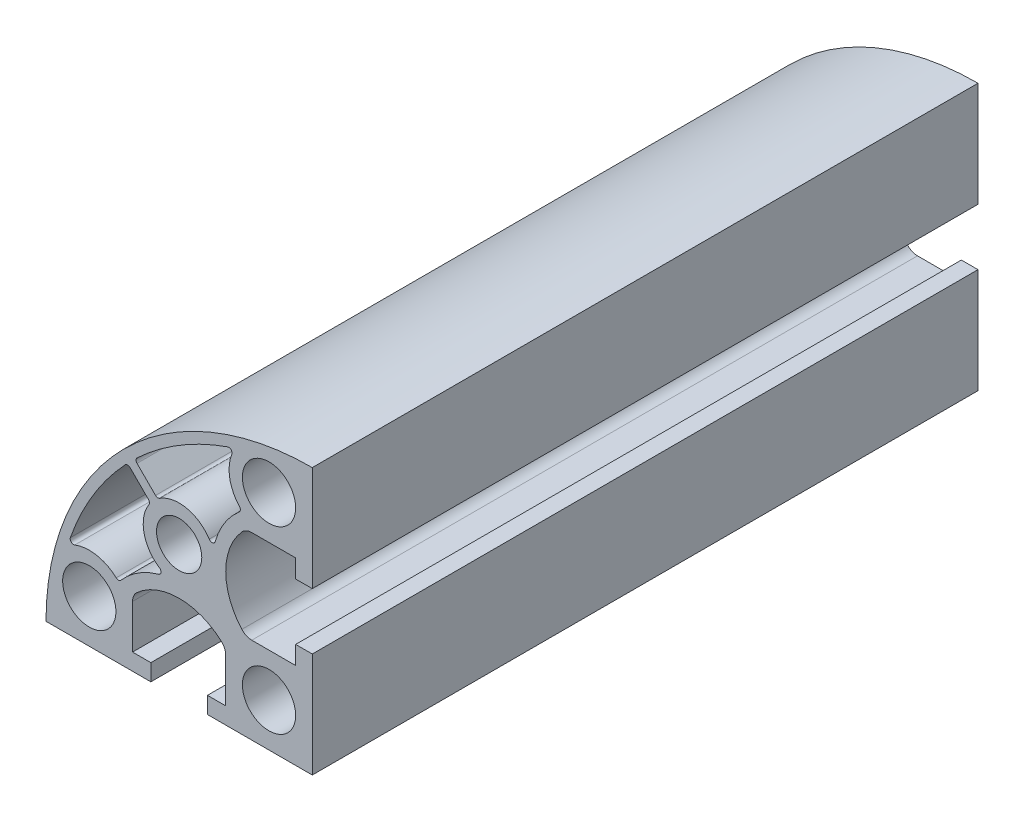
ISO-10303-21;
HEADER;
FILE_DESCRIPTION(('STEP AP214'),'2;1');
FILE_NAME('part.step','',(''),(''),'','','');
FILE_SCHEMA(('AUTOMOTIVE_DESIGN { 1 0 10303 214 1 1 1 1 }'));
ENDSEC;
DATA;
#1=APPLICATION_CONTEXT('core data for automotive mechanical design processes');
#2=APPLICATION_PROTOCOL_DEFINITION('international standard','automotive_design',2000,#1);
#3=PRODUCT_CONTEXT('',#1,'mechanical');
#4=PRODUCT('Part','Part','',(#3));
#5=PRODUCT_RELATED_PRODUCT_CATEGORY('part','',(#4));
#6=PRODUCT_DEFINITION_FORMATION('','',#4);
#7=PRODUCT_DEFINITION_CONTEXT('part definition',#1,'design');
#8=PRODUCT_DEFINITION('design','',#6,#7);
#9=PRODUCT_DEFINITION_SHAPE('','',#8);
#10=(LENGTH_UNIT() NAMED_UNIT(*) SI_UNIT(.MILLI.,.METRE.));
#11=(NAMED_UNIT(*) PLANE_ANGLE_UNIT() SI_UNIT($,.RADIAN.));
#12=(NAMED_UNIT(*) SI_UNIT($,.STERADIAN.) SOLID_ANGLE_UNIT());
#13=UNCERTAINTY_MEASURE_WITH_UNIT(LENGTH_MEASURE(1.E-05),#10,'distance_accuracy_value','');
#14=(GEOMETRIC_REPRESENTATION_CONTEXT(3) GLOBAL_UNCERTAINTY_ASSIGNED_CONTEXT((#13)) GLOBAL_UNIT_ASSIGNED_CONTEXT((#10,
#11,#12)) REPRESENTATION_CONTEXT('',''));
#15=CARTESIAN_POINT('',(0.,0.,0.));
#16=DIRECTION('',(0.,0.,1.));
#17=DIRECTION('',(1.,0.,0.));
#18=AXIS2_PLACEMENT_3D('',#15,#16,#17);
#19=CARTESIAN_POINT('',(20.,20.,50.));
#20=DIRECTION('',(-1.,0.,0.));
#21=DIRECTION('',(0.,0.,1.));
#22=AXIS2_PLACEMENT_3D('',#19,#20,#21);
#23=PLANE('',#22);
#24=DIRECTION('',(0.,1.,0.));
#25=VECTOR('',#24,1.);
#26=CARTESIAN_POINT('',(20.,20.,50.));
#27=LINE('',#26,#25);
#28=CARTESIAN_POINT('',(20.,4.25000000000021,50.));
#29=VERTEX_POINT('',#28);
#30=CARTESIAN_POINT('',(20.,20.,50.));
#31=VERTEX_POINT('',#30);
#32=EDGE_CURVE('E657',#29,#31,#27,.T.);
#33=ORIENTED_EDGE('',*,*,#32,.F.);
#34=DIRECTION('',(0.,0.,1.));
#35=VECTOR('',#34,1.);
#36=CARTESIAN_POINT('',(20.,4.25000000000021,-50.));
#37=LINE('',#36,#35);
#38=CARTESIAN_POINT('',(20.,4.25000000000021,-50.));
#39=VERTEX_POINT('',#38);
#40=EDGE_CURVE('E536',#39,#29,#37,.T.);
#41=ORIENTED_EDGE('',*,*,#40,.F.);
#42=DIRECTION('',(0.,1.,0.));
#43=VECTOR('',#42,1.);
#44=CARTESIAN_POINT('',(20.,20.,-50.));
#45=LINE('',#44,#43);
#46=CARTESIAN_POINT('',(20.,20.,-50.));
#47=VERTEX_POINT('',#46);
#48=EDGE_CURVE('E650',#39,#47,#45,.T.);
#49=ORIENTED_EDGE('',*,*,#48,.T.);
#50=DIRECTION('',(0.,0.,-1.));
#51=VECTOR('',#50,1.);
#52=CARTESIAN_POINT('',(20.,20.,50.));
#53=LINE('',#52,#51);
#54=EDGE_CURVE('E12',#31,#47,#53,.T.);
#55=ORIENTED_EDGE('',*,*,#54,.F.);
#56=EDGE_LOOP('',(#33,#41,#49,#55));
#57=FACE_BOUND('',#56,.T.);
#58=ADVANCED_FACE('F36',(#57),#23,.F.);
#59=CARTESIAN_POINT('',(-20.,-20.,50.));
#60=DIRECTION('',(0.,1.,0.));
#61=DIRECTION('',(0.,0.,1.));
#62=AXIS2_PLACEMENT_3D('',#59,#60,#61);
#63=PLANE('',#62);
#64=DIRECTION('',(1.,0.,0.));
#65=VECTOR('',#64,1.);
#66=CARTESIAN_POINT('',(-20.,-20.,50.));
#67=LINE('',#66,#65);
#68=CARTESIAN_POINT('',(4.25,-20.,50.));
#69=VERTEX_POINT('',#68);
#70=CARTESIAN_POINT('',(20.,-20.,50.));
#71=VERTEX_POINT('',#70);
#72=EDGE_CURVE('E656',#69,#71,#67,.T.);
#73=ORIENTED_EDGE('',*,*,#72,.F.);
#74=DIRECTION('',(0.,0.,1.));
#75=VECTOR('',#74,1.);
#76=CARTESIAN_POINT('',(4.25,-20.,-50.));
#77=LINE('',#76,#75);
#78=CARTESIAN_POINT('',(4.25,-20.,-50.));
#79=VERTEX_POINT('',#78);
#80=EDGE_CURVE('E608',#79,#69,#77,.T.);
#81=ORIENTED_EDGE('',*,*,#80,.F.);
#82=DIRECTION('',(1.,0.,0.));
#83=VECTOR('',#82,1.);
#84=CARTESIAN_POINT('',(-20.,-20.,-50.));
#85=LINE('',#84,#83);
#86=CARTESIAN_POINT('',(20.,-20.,-50.));
#87=VERTEX_POINT('',#86);
#88=EDGE_CURVE('E665',#79,#87,#85,.T.);
#89=ORIENTED_EDGE('',*,*,#88,.T.);
#90=DIRECTION('',(0.,0.,-1.));
#91=VECTOR('',#90,1.);
#92=CARTESIAN_POINT('',(20.,-20.,50.));
#93=LINE('',#92,#91);
#94=EDGE_CURVE('E661',#71,#87,#93,.T.);
#95=ORIENTED_EDGE('',*,*,#94,.F.);
#96=EDGE_LOOP('',(#73,#81,#89,#95));
#97=FACE_BOUND('',#96,.T.);
#98=ADVANCED_FACE('F738',(#97),#63,.F.);
#99=CARTESIAN_POINT('',(20.,-4.24999999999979,-50.));
#100=VERTEX_POINT('',#99);
#101=EDGE_CURVE('E662',#87,#100,#45,.T.);
#102=ORIENTED_EDGE('',*,*,#101,.T.);
#103=DIRECTION('',(0.,0.,1.));
#104=VECTOR('',#103,1.);
#105=CARTESIAN_POINT('',(20.,-4.24999999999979,-50.));
#106=LINE('',#105,#104);
#107=CARTESIAN_POINT('',(20.,-4.24999999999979,50.));
#108=VERTEX_POINT('',#107);
#109=EDGE_CURVE('E539',#100,#108,#106,.T.);
#110=ORIENTED_EDGE('',*,*,#109,.T.);
#111=EDGE_CURVE('E653',#71,#108,#27,.T.);
#112=ORIENTED_EDGE('',*,*,#111,.F.);
#113=ORIENTED_EDGE('',*,*,#94,.T.);
#114=EDGE_LOOP('',(#102,#110,#112,#113));
#115=FACE_BOUND('',#114,.T.);
#116=ADVANCED_FACE('F38',(#115),#23,.F.);
#117=CARTESIAN_POINT('',(-20.,-20.,-50.));
#118=VERTEX_POINT('',#117);
#119=CARTESIAN_POINT('',(-4.25,-20.,-50.));
#120=VERTEX_POINT('',#119);
#121=EDGE_CURVE('E666',#118,#120,#85,.T.);
#122=ORIENTED_EDGE('',*,*,#121,.T.);
#123=DIRECTION('',(0.,0.,1.));
#124=VECTOR('',#123,1.);
#125=CARTESIAN_POINT('',(-4.25,-20.,-50.));
#126=LINE('',#125,#124);
#127=CARTESIAN_POINT('',(-4.25,-20.,50.));
#128=VERTEX_POINT('',#127);
#129=EDGE_CURVE('E611',#120,#128,#126,.T.);
#130=ORIENTED_EDGE('',*,*,#129,.T.);
#131=CARTESIAN_POINT('',(-20.,-20.,50.));
#132=VERTEX_POINT('',#131);
#133=EDGE_CURVE('E658',#132,#128,#67,.T.);
#134=ORIENTED_EDGE('',*,*,#133,.F.);
#135=DIRECTION('',(0.,0.,-1.));
#136=VECTOR('',#135,1.);
#137=CARTESIAN_POINT('',(-20.,-20.,50.));
#138=LINE('',#137,#136);
#139=EDGE_CURVE('E44',#132,#118,#138,.T.);
#140=ORIENTED_EDGE('',*,*,#139,.T.);
#141=EDGE_LOOP('',(#122,#130,#134,#140));
#142=FACE_BOUND('',#141,.T.);
#143=ADVANCED_FACE('F675',(#142),#63,.F.);
#144=CARTESIAN_POINT('',(20.,-20.,50.));
#145=DIRECTION('',(0.,0.,1.));
#146=DIRECTION('',(1.,0.,0.));
#147=AXIS2_PLACEMENT_3D('',#144,#145,#146);
#148=PLANE('',#147);
#149=CARTESIAN_POINT('',(-15.8664003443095,-7.44606331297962,50.));
#150=DIRECTION('',(0.,0.,1.));
#151=DIRECTION('',(1.,0.,0.));
#152=AXIS2_PLACEMENT_3D('',#149,#150,#151);
#153=CIRCLE('',#152,0.500000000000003);
#154=CARTESIAN_POINT('',(-16.3383266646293,-7.28087993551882,50.));
#155=VERTEX_POINT('',#154);
#156=CARTESIAN_POINT('',(-15.6843695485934,-7.91175075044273,50.));
#157=VERTEX_POINT('',#156);
#158=EDGE_CURVE('E340',#155,#157,#153,.T.);
#159=ORIENTED_EDGE('',*,*,#158,.F.);
#160=CARTESIAN_POINT('',(20.,-20.,50.));
#161=DIRECTION('',(0.,0.,-1.));
#162=DIRECTION('',(1.,0.,0.));
#163=AXIS2_PLACEMENT_3D('',#160,#161,#162);
#164=CIRCLE('',#163,38.5);
#165=CARTESIAN_POINT('',(-8.10439177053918,6.31336472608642,50.));
#166=VERTEX_POINT('',#165);
#167=EDGE_CURVE('E479',#155,#166,#164,.T.);
#168=ORIENTED_EDGE('',*,*,#167,.T.);
#169=CARTESIAN_POINT('',(-7.73939966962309,5.97163271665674,50.));
#170=DIRECTION('',(0.,0.,1.));
#171=DIRECTION('',(1.,0.,0.));
#172=AXIS2_PLACEMENT_3D('',#169,#170,#171);
#173=CIRCLE('',#172,0.499999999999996);
#174=CARTESIAN_POINT('',(-7.38584627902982,6.32518610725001,50.));
#175=VERTEX_POINT('',#174);
#176=EDGE_CURVE('E374',#175,#166,#173,.T.);
#177=ORIENTED_EDGE('',*,*,#176,.F.);
#178=DIRECTION('',(-0.707106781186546,0.707106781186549,0.));
#179=VECTOR('',#178,1.);
#180=CARTESIAN_POINT('',(-4.60755340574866,3.54689323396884,50.));
#181=LINE('',#180,#179);
#182=CARTESIAN_POINT('',(-4.60755340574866,3.54689323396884,50.));
#183=VERTEX_POINT('',#182);
#184=EDGE_CURVE('E371',#183,#175,#181,.T.);
#185=ORIENTED_EDGE('',*,*,#184,.F.);
#186=CARTESIAN_POINT('',(-4.96110679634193,3.19333984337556,50.));
#187=DIRECTION('',(0.,0.,1.));
#188=DIRECTION('',(-1.,0.,0.));
#189=AXIS2_PLACEMENT_3D('',#186,#187,#188);
#190=CIRCLE('',#189,0.499999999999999);
#191=CARTESIAN_POINT('',(-4.54067401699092,2.92271782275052,50.));
#192=VERTEX_POINT('',#191);
#193=EDGE_CURVE('E368',#192,#183,#190,.T.);
#194=ORIENTED_EDGE('',*,*,#193,.F.);
#195=CARTESIAN_POINT('',(0.,0.,50.));
#196=DIRECTION('',(0.,0.,-1.));
#197=DIRECTION('',(1.,0.,0.));
#198=AXIS2_PLACEMENT_3D('',#195,#196,#197);
#199=CIRCLE('',#198,5.4);
#200=CARTESIAN_POINT('',(-2.95081468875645,-4.52246533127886,50.));
#201=VERTEX_POINT('',#200);
#202=EDGE_CURVE('E365',#201,#192,#199,.T.);
#203=ORIENTED_EDGE('',*,*,#202,.F.);
#204=CARTESIAN_POINT('',(-3.22403827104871,-4.94121212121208,50.));
#205=DIRECTION('',(0.,0.,1.));
#206=DIRECTION('',(1.,0.,0.));
#207=AXIS2_PLACEMENT_3D('',#204,#205,#206);
#208=CIRCLE('',#207,0.499999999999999);
#209=CARTESIAN_POINT('',(-3.08970334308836,-5.42282828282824,50.));
#210=VERTEX_POINT('',#209);
#211=EDGE_CURVE('E362',#210,#201,#208,.T.);
#212=ORIENTED_EDGE('',*,*,#211,.F.);
#213=CARTESIAN_POINT('',(-1.90819582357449E-13,-16.5,50.));
#214=DIRECTION('',(0.,0.,-1.));
#215=DIRECTION('',(-1.,0.,0.));
#216=AXIS2_PLACEMENT_3D('',#213,#214,#215);
#217=CIRCLE('',#216,11.5);
#218=CARTESIAN_POINT('',(-8.73834752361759,-9.02395274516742,50.));
#219=VERTEX_POINT('',#218);
#220=EDGE_CURVE('E360',#219,#210,#217,.T.);
#221=ORIENTED_EDGE('',*,*,#220,.F.);
#222=CARTESIAN_POINT('',(-9.11827567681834,-8.69890721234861,50.));
#223=DIRECTION('',(0.,0.,1.));
#224=DIRECTION('',(-1.,0.,0.));
#225=AXIS2_PLACEMENT_3D('',#222,#223,#224);
#226=CIRCLE('',#225,0.499999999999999);
#227=CARTESIAN_POINT('',(-9.45533139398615,-9.06822204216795,50.));
#228=VERTEX_POINT('',#227);
#229=EDGE_CURVE('E318',#228,#219,#226,.T.);
#230=ORIENTED_EDGE('',*,*,#229,.F.);
#231=CARTESIAN_POINT('',(-13.5,-13.5,50.));
#232=DIRECTION('',(0.,0.,-1.));
#233=DIRECTION('',(1.,0.,0.));
#234=AXIS2_PLACEMENT_3D('',#231,#232,#233);
#235=CIRCLE('',#234,6.);
#236=EDGE_CURVE('E337',#157,#228,#235,.T.);
#237=ORIENTED_EDGE('',*,*,#236,.F.);
#238=EDGE_LOOP('',(#159,#168,#177,#185,#194,#203,#212,#221,#230,#237));
#239=FACE_BOUND('',#238,.T.);
#240=CARTESIAN_POINT('',(-5.97163271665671,7.73939966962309,50.));
#241=DIRECTION('',(0.,0.,1.));
#242=DIRECTION('',(-1.,0.,0.));
#243=AXIS2_PLACEMENT_3D('',#240,#241,#242);
#244=CIRCLE('',#243,0.499999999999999);
#245=CARTESIAN_POINT('',(-6.31336472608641,8.10439177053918,50.));
#246=VERTEX_POINT('',#245);
#247=CARTESIAN_POINT('',(-6.32518610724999,7.38584627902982,50.));
#248=VERTEX_POINT('',#247);
#249=EDGE_CURVE('E442',#246,#248,#244,.T.);
#250=ORIENTED_EDGE('',*,*,#249,.F.);
#251=CARTESIAN_POINT('',(7.28087993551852,16.3383266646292,50.));
#252=VERTEX_POINT('',#251);
#253=EDGE_CURVE('E455',#246,#252,#164,.T.);
#254=ORIENTED_EDGE('',*,*,#253,.T.);
#255=CARTESIAN_POINT('',(7.44606331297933,15.8664003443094,50.));
#256=DIRECTION('',(0.,0.,1.));
#257=DIRECTION('',(-1.,0.,0.));
#258=AXIS2_PLACEMENT_3D('',#255,#256,#257);
#259=CIRCLE('',#258,0.5);
#260=CARTESIAN_POINT('',(7.91175075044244,15.6843695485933,50.));
#261=VERTEX_POINT('',#260);
#262=EDGE_CURVE('E439',#261,#252,#259,.T.);
#263=ORIENTED_EDGE('',*,*,#262,.F.);
#264=CARTESIAN_POINT('',(13.4999999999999,13.5000000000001,50.));
#265=DIRECTION('',(0.,0.,-1.));
#266=DIRECTION('',(1.,0.,0.));
#267=AXIS2_PLACEMENT_3D('',#264,#265,#266);
#268=CIRCLE('',#267,6.);
#269=CARTESIAN_POINT('',(9.06822204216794,9.45533139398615,50.));
#270=VERTEX_POINT('',#269);
#271=EDGE_CURVE('E436',#270,#261,#268,.T.);
#272=ORIENTED_EDGE('',*,*,#271,.F.);
#273=CARTESIAN_POINT('',(8.69890721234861,9.11827567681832,50.));
#274=DIRECTION('',(0.,0.,1.));
#275=DIRECTION('',(-1.,0.,0.));
#276=AXIS2_PLACEMENT_3D('',#273,#274,#275);
#277=CIRCLE('',#276,0.499999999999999);
#278=CARTESIAN_POINT('',(9.02395274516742,8.73834752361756,50.));
#279=VERTEX_POINT('',#278);
#280=EDGE_CURVE('E433',#279,#270,#277,.T.);
#281=ORIENTED_EDGE('',*,*,#280,.F.);
#282=CARTESIAN_POINT('',(16.5,1.72828326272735E-13,50.));
#283=DIRECTION('',(0.,0.,-1.));
#284=DIRECTION('',(1.,0.,0.));
#285=AXIS2_PLACEMENT_3D('',#282,#283,#284);
#286=CIRCLE('',#285,11.5);
#287=CARTESIAN_POINT('',(5.42282828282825,3.08970334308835,50.));
#288=VERTEX_POINT('',#287);
#289=EDGE_CURVE('E430',#288,#279,#286,.T.);
#290=ORIENTED_EDGE('',*,*,#289,.F.);
#291=CARTESIAN_POINT('',(4.94121212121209,3.22403827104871,50.));
#292=DIRECTION('',(0.,0.,1.));
#293=DIRECTION('',(1.,0.,0.));
#294=AXIS2_PLACEMENT_3D('',#291,#292,#293);
#295=CIRCLE('',#294,0.5);
#296=CARTESIAN_POINT('',(4.52246533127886,2.95081468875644,50.));
#297=VERTEX_POINT('',#296);
#298=EDGE_CURVE('E381',#297,#288,#295,.T.);
#299=ORIENTED_EDGE('',*,*,#298,.F.);
#300=CARTESIAN_POINT('',(0.,0.,50.));
#301=DIRECTION('',(0.,0.,-1.));
#302=DIRECTION('',(1.,0.,0.));
#303=AXIS2_PLACEMENT_3D('',#300,#301,#302);
#304=CIRCLE('',#303,5.4);
#305=CARTESIAN_POINT('',(-2.92271782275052,4.54067401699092,50.));
#306=VERTEX_POINT('',#305);
#307=EDGE_CURVE('E403',#306,#297,#304,.T.);
#308=ORIENTED_EDGE('',*,*,#307,.F.);
#309=CARTESIAN_POINT('',(-3.19333984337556,4.96110679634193,50.));
#310=DIRECTION('',(0.,0.,1.));
#311=DIRECTION('',(1.,0.,0.));
#312=AXIS2_PLACEMENT_3D('',#309,#310,#311);
#313=CIRCLE('',#312,0.499999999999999);
#314=CARTESIAN_POINT('',(-3.54689323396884,4.60755340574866,50.));
#315=VERTEX_POINT('',#314);
#316=EDGE_CURVE('E448',#315,#306,#313,.T.);
#317=ORIENTED_EDGE('',*,*,#316,.F.);
#318=DIRECTION('',(0.707106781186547,-0.707106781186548,0.));
#319=VECTOR('',#318,1.);
#320=CARTESIAN_POINT('',(-3.54689323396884,4.60755340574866,50.));
#321=LINE('',#320,#319);
#322=EDGE_CURVE('E445',#248,#315,#321,.T.);
#323=ORIENTED_EDGE('',*,*,#322,.F.);
#324=EDGE_LOOP('',(#250,#254,#263,#272,#281,#290,#299,#308,#317,#323));
#325=FACE_BOUND('',#324,.T.);
#326=ORIENTED_EDGE('',*,*,#32,.T.);
#327=CARTESIAN_POINT('',(20.,-20.,50.));
#328=DIRECTION('',(0.,0.,-1.));
#329=DIRECTION('',(1.,0.,0.));
#330=AXIS2_PLACEMENT_3D('',#327,#328,#329);
#331=CIRCLE('',#330,40.);
#332=EDGE_CURVE('E477',#132,#31,#331,.T.);
#333=ORIENTED_EDGE('',*,*,#332,.F.);
#334=ORIENTED_EDGE('',*,*,#133,.T.);
#335=DIRECTION('',(0.,-1.,0.));
#336=VECTOR('',#335,1.);
#337=CARTESIAN_POINT('',(-4.25,-20.,50.));
#338=LINE('',#337,#336);
#339=CARTESIAN_POINT('',(-4.25,-17.5,50.));
#340=VERTEX_POINT('',#339);
#341=EDGE_CURVE('E561',#340,#128,#338,.T.);
#342=ORIENTED_EDGE('',*,*,#341,.F.);
#343=DIRECTION('',(1.,0.,0.));
#344=VECTOR('',#343,1.);
#345=CARTESIAN_POINT('',(-4.25,-17.5,50.));
#346=LINE('',#345,#344);
#347=CARTESIAN_POINT('',(-7.,-17.5,50.));
#348=VERTEX_POINT('',#347);
#349=EDGE_CURVE('E604',#348,#340,#346,.T.);
#350=ORIENTED_EDGE('',*,*,#349,.F.);
#351=DIRECTION('',(0.,-1.,0.));
#352=VECTOR('',#351,1.);
#353=CARTESIAN_POINT('',(-7.,-17.5,50.));
#354=LINE('',#353,#352);
#355=CARTESIAN_POINT('',(-7.,-10.9098300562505,50.));
#356=VERTEX_POINT('',#355);
#357=EDGE_CURVE('E601',#356,#348,#354,.T.);
#358=ORIENTED_EDGE('',*,*,#357,.F.);
#359=CARTESIAN_POINT('',(-5.,-10.9098300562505,50.));
#360=DIRECTION('',(0.,0.,1.));
#361=DIRECTION('',(1.,0.,0.));
#362=AXIS2_PLACEMENT_3D('',#359,#360,#361);
#363=CIRCLE('',#362,2.);
#364=CARTESIAN_POINT('',(-6.33333333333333,-9.41911807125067,50.));
#365=VERTEX_POINT('',#364);
#366=EDGE_CURVE('E598',#365,#356,#363,.T.);
#367=ORIENTED_EDGE('',*,*,#366,.F.);
#368=CARTESIAN_POINT('',(0.,-16.5,50.));
#369=DIRECTION('',(0.,0.,1.));
#370=DIRECTION('',(-1.,0.,0.));
#371=AXIS2_PLACEMENT_3D('',#368,#369,#370);
#372=CIRCLE('',#371,9.5);
#373=CARTESIAN_POINT('',(6.33333333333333,-9.41911807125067,50.));
#374=VERTEX_POINT('',#373);
#375=EDGE_CURVE('E595',#374,#365,#372,.T.);
#376=ORIENTED_EDGE('',*,*,#375,.F.);
#377=CARTESIAN_POINT('',(5.,-10.9098300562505,50.));
#378=DIRECTION('',(0.,0.,1.));
#379=DIRECTION('',(-1.,0.,0.));
#380=AXIS2_PLACEMENT_3D('',#377,#378,#379);
#381=CIRCLE('',#380,2.);
#382=CARTESIAN_POINT('',(7.,-10.9098300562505,50.));
#383=VERTEX_POINT('',#382);
#384=EDGE_CURVE('E592',#383,#374,#381,.T.);
#385=ORIENTED_EDGE('',*,*,#384,.F.);
#386=DIRECTION('',(0.,1.,0.));
#387=VECTOR('',#386,1.);
#388=CARTESIAN_POINT('',(7.,-17.5,50.));
#389=LINE('',#388,#387);
#390=CARTESIAN_POINT('',(7.,-17.5,50.));
#391=VERTEX_POINT('',#390);
#392=EDGE_CURVE('E589',#391,#383,#389,.T.);
#393=ORIENTED_EDGE('',*,*,#392,.F.);
#394=DIRECTION('',(1.,0.,0.));
#395=VECTOR('',#394,1.);
#396=CARTESIAN_POINT('',(4.25,-17.5,50.));
#397=LINE('',#396,#395);
#398=CARTESIAN_POINT('',(4.25,-17.5,50.));
#399=VERTEX_POINT('',#398);
#400=EDGE_CURVE('E586',#399,#391,#397,.T.);
#401=ORIENTED_EDGE('',*,*,#400,.F.);
#402=DIRECTION('',(0.,1.,0.));
#403=VECTOR('',#402,1.);
#404=CARTESIAN_POINT('',(4.25,-20.,50.));
#405=LINE('',#404,#403);
#406=EDGE_CURVE('E538',#69,#399,#405,.T.);
#407=ORIENTED_EDGE('',*,*,#406,.F.);
#408=ORIENTED_EDGE('',*,*,#72,.T.);
#409=ORIENTED_EDGE('',*,*,#111,.T.);
#410=DIRECTION('',(1.,0.,0.));
#411=VECTOR('',#410,1.);
#412=CARTESIAN_POINT('',(20.,-4.24999999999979,50.));
#413=LINE('',#412,#411);
#414=CARTESIAN_POINT('',(17.5,-4.24999999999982,50.));
#415=VERTEX_POINT('',#414);
#416=EDGE_CURVE('E489',#415,#108,#413,.T.);
#417=ORIENTED_EDGE('',*,*,#416,.F.);
#418=DIRECTION('',(0.,1.,0.));
#419=VECTOR('',#418,1.);
#420=CARTESIAN_POINT('',(17.5,-4.24999999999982,50.));
#421=LINE('',#420,#419);
#422=CARTESIAN_POINT('',(17.5000000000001,-6.99999999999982,50.));
#423=VERTEX_POINT('',#422);
#424=EDGE_CURVE('E532',#423,#415,#421,.T.);
#425=ORIENTED_EDGE('',*,*,#424,.F.);
#426=DIRECTION('',(1.,0.,0.));
#427=VECTOR('',#426,1.);
#428=CARTESIAN_POINT('',(17.5000000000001,-6.99999999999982,50.));
#429=LINE('',#428,#427);
#430=CARTESIAN_POINT('',(10.9098300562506,-6.99999999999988,50.));
#431=VERTEX_POINT('',#430);
#432=EDGE_CURVE('E529',#431,#423,#429,.T.);
#433=ORIENTED_EDGE('',*,*,#432,.F.);
#434=CARTESIAN_POINT('',(10.9098300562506,-4.99999999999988,50.));
#435=DIRECTION('',(0.,0.,1.));
#436=DIRECTION('',(0.,1.,0.));
#437=AXIS2_PLACEMENT_3D('',#434,#435,#436);
#438=CIRCLE('',#437,2.);
#439=CARTESIAN_POINT('',(9.41911807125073,-6.33333333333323,50.));
#440=VERTEX_POINT('',#439);
#441=EDGE_CURVE('E526',#440,#431,#438,.T.);
#442=ORIENTED_EDGE('',*,*,#441,.F.);
#443=CARTESIAN_POINT('',(16.5,1.72828326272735E-13,50.));
#444=DIRECTION('',(0.,0.,1.));
#445=DIRECTION('',(0.,-1.,0.));
#446=AXIS2_PLACEMENT_3D('',#443,#444,#445);
#447=CIRCLE('',#446,9.5);
#448=CARTESIAN_POINT('',(9.4191180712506,6.33333333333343,50.));
#449=VERTEX_POINT('',#448);
#450=EDGE_CURVE('E523',#449,#440,#447,.T.);
#451=ORIENTED_EDGE('',*,*,#450,.F.);
#452=CARTESIAN_POINT('',(10.9098300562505,5.00000000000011,50.));
#453=DIRECTION('',(0.,0.,1.));
#454=DIRECTION('',(0.,-1.,0.));
#455=AXIS2_PLACEMENT_3D('',#452,#453,#454);
#456=CIRCLE('',#455,2.);
#457=CARTESIAN_POINT('',(10.9098300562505,7.00000000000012,50.));
#458=VERTEX_POINT('',#457);
#459=EDGE_CURVE('E520',#458,#449,#456,.T.);
#460=ORIENTED_EDGE('',*,*,#459,.F.);
#461=DIRECTION('',(-1.,0.,0.));
#462=VECTOR('',#461,1.);
#463=CARTESIAN_POINT('',(17.4999999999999,7.00000000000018,50.));
#464=LINE('',#463,#462);
#465=CARTESIAN_POINT('',(17.4999999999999,7.00000000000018,50.));
#466=VERTEX_POINT('',#465);
#467=EDGE_CURVE('E517',#466,#458,#464,.T.);
#468=ORIENTED_EDGE('',*,*,#467,.F.);
#469=DIRECTION('',(0.,1.,0.));
#470=VECTOR('',#469,1.);
#471=CARTESIAN_POINT('',(17.5,4.25000000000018,50.));
#472=LINE('',#471,#470);
#473=CARTESIAN_POINT('',(17.5,4.25000000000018,50.));
#474=VERTEX_POINT('',#473);
#475=EDGE_CURVE('E514',#474,#466,#472,.T.);
#476=ORIENTED_EDGE('',*,*,#475,.F.);
#477=DIRECTION('',(-1.,0.,0.));
#478=VECTOR('',#477,1.);
#479=CARTESIAN_POINT('',(20.,4.25000000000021,50.));
#480=LINE('',#479,#478);
#481=EDGE_CURVE('E483',#29,#474,#480,.T.);
#482=ORIENTED_EDGE('',*,*,#481,.F.);
#483=EDGE_LOOP('',(#326,#333,#334,#342,#350,#358,#367,#376,#385,#393,#401,#407,#408,#409,#417,
#425,#433,#442,#451,#460,#468,#476,#482));
#484=FACE_BOUND('',#483,.T.);
#485=CARTESIAN_POINT('',(13.4999999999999,13.5000000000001,50.));
#486=DIRECTION('',(0.,0.,1.));
#487=DIRECTION('',(0.,-1.,0.));
#488=AXIS2_PLACEMENT_3D('',#485,#486,#487);
#489=CIRCLE('',#488,4.);
#490=CARTESIAN_POINT('',(13.4999999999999,9.50000000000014,50.));
#491=VERTEX_POINT('',#490);
#492=EDGE_CURVE('E610',#491,#491,#489,.T.);
#493=ORIENTED_EDGE('',*,*,#492,.F.);
#494=EDGE_LOOP('',(#493));
#495=FACE_BOUND('',#494,.T.);
#496=CARTESIAN_POINT('',(13.5,-13.5,50.));
#497=DIRECTION('',(0.,0.,1.));
#498=DIRECTION('',(-1.,0.,0.));
#499=AXIS2_PLACEMENT_3D('',#496,#497,#498);
#500=CIRCLE('',#499,4.);
#501=CARTESIAN_POINT('',(9.5,-13.5,50.));
#502=VERTEX_POINT('',#501);
#503=EDGE_CURVE('E632',#502,#502,#500,.T.);
#504=ORIENTED_EDGE('',*,*,#503,.F.);
#505=EDGE_LOOP('',(#504));
#506=FACE_BOUND('',#505,.T.);
#507=CARTESIAN_POINT('',(-13.5,-13.5,50.));
#508=DIRECTION('',(0.,0.,1.));
#509=DIRECTION('',(0.,1.,0.));
#510=AXIS2_PLACEMENT_3D('',#507,#508,#509);
#511=CIRCLE('',#510,4.);
#512=CARTESIAN_POINT('',(-13.5,-9.50000000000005,50.));
#513=VERTEX_POINT('',#512);
#514=EDGE_CURVE('E638',#513,#513,#511,.T.);
#515=ORIENTED_EDGE('',*,*,#514,.F.);
#516=EDGE_LOOP('',(#515));
#517=FACE_BOUND('',#516,.T.);
#518=CARTESIAN_POINT('',(0.,0.,50.));
#519=DIRECTION('',(0.,0.,1.));
#520=DIRECTION('',(1.,0.,0.));
#521=AXIS2_PLACEMENT_3D('',#518,#519,#520);
#522=CIRCLE('',#521,3.4);
#523=CARTESIAN_POINT('',(3.4,0.,50.));
#524=VERTEX_POINT('',#523);
#525=EDGE_CURVE('E644',#524,#524,#522,.T.);
#526=ORIENTED_EDGE('',*,*,#525,.F.);
#527=EDGE_LOOP('',(#526));
#528=FACE_BOUND('',#527,.T.);
#529=ADVANCED_FACE('F687',(#239,#325,#484,#495,#506,#517,#528),#148,.T.);
#530=CARTESIAN_POINT('',(20.,-20.,-50.));
#531=DIRECTION('',(0.,0.,1.));
#532=DIRECTION('',(1.,0.,0.));
#533=AXIS2_PLACEMENT_3D('',#530,#531,#532);
#534=PLANE('',#533);
#535=CARTESIAN_POINT('',(20.,-20.,-50.));
#536=DIRECTION('',(0.,0.,1.));
#537=DIRECTION('',(1.,0.,0.));
#538=AXIS2_PLACEMENT_3D('',#535,#536,#537);
#539=CIRCLE('',#538,38.5);
#540=CARTESIAN_POINT('',(-8.10439177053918,6.31336472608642,-50.));
#541=VERTEX_POINT('',#540);
#542=CARTESIAN_POINT('',(-16.3383266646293,-7.28087993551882,-50.));
#543=VERTEX_POINT('',#542);
#544=EDGE_CURVE('E478',#541,#543,#539,.T.);
#545=ORIENTED_EDGE('',*,*,#544,.T.);
#546=CARTESIAN_POINT('',(-15.8664003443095,-7.44606331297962,-50.));
#547=DIRECTION('',(0.,0.,1.));
#548=DIRECTION('',(1.,0.,0.));
#549=AXIS2_PLACEMENT_3D('',#546,#547,#548);
#550=CIRCLE('',#549,0.500000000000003);
#551=CARTESIAN_POINT('',(-15.6843695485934,-7.91175075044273,-50.));
#552=VERTEX_POINT('',#551);
#553=EDGE_CURVE('E356',#543,#552,#550,.T.);
#554=ORIENTED_EDGE('',*,*,#553,.T.);
#555=CARTESIAN_POINT('',(-13.5,-13.5,-50.));
#556=DIRECTION('',(0.,0.,-1.));
#557=DIRECTION('',(1.,0.,0.));
#558=AXIS2_PLACEMENT_3D('',#555,#556,#557);
#559=CIRCLE('',#558,6.);
#560=CARTESIAN_POINT('',(-9.45533139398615,-9.06822204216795,-50.));
#561=VERTEX_POINT('',#560);
#562=EDGE_CURVE('E323',#552,#561,#559,.T.);
#563=ORIENTED_EDGE('',*,*,#562,.T.);
#564=CARTESIAN_POINT('',(-9.11827567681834,-8.69890721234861,-50.));
#565=DIRECTION('',(0.,0.,1.));
#566=DIRECTION('',(-1.,0.,0.));
#567=AXIS2_PLACEMENT_3D('',#564,#565,#566);
#568=CIRCLE('',#567,0.499999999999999);
#569=CARTESIAN_POINT('',(-8.73834752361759,-9.02395274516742,-50.));
#570=VERTEX_POINT('',#569);
#571=EDGE_CURVE('E315',#561,#570,#568,.T.);
#572=ORIENTED_EDGE('',*,*,#571,.T.);
#573=CARTESIAN_POINT('',(-1.90819582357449E-13,-16.5,-50.));
#574=DIRECTION('',(0.,0.,-1.));
#575=DIRECTION('',(-1.,0.,0.));
#576=AXIS2_PLACEMENT_3D('',#573,#574,#575);
#577=CIRCLE('',#576,11.5);
#578=CARTESIAN_POINT('',(-3.08970334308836,-5.42282828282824,-50.));
#579=VERTEX_POINT('',#578);
#580=EDGE_CURVE('E326',#570,#579,#577,.T.);
#581=ORIENTED_EDGE('',*,*,#580,.T.);
#582=CARTESIAN_POINT('',(-3.22403827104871,-4.94121212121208,-50.));
#583=DIRECTION('',(0.,0.,1.));
#584=DIRECTION('',(1.,0.,0.));
#585=AXIS2_PLACEMENT_3D('',#582,#583,#584);
#586=CIRCLE('',#585,0.499999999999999);
#587=CARTESIAN_POINT('',(-2.95081468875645,-4.52246533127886,-50.));
#588=VERTEX_POINT('',#587);
#589=EDGE_CURVE('E331',#579,#588,#586,.T.);
#590=ORIENTED_EDGE('',*,*,#589,.T.);
#591=CARTESIAN_POINT('',(0.,0.,-50.));
#592=DIRECTION('',(0.,0.,-1.));
#593=DIRECTION('',(1.,0.,0.));
#594=AXIS2_PLACEMENT_3D('',#591,#592,#593);
#595=CIRCLE('',#594,5.4);
#596=CARTESIAN_POINT('',(-4.54067401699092,2.92271782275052,-50.));
#597=VERTEX_POINT('',#596);
#598=EDGE_CURVE('E344',#588,#597,#595,.T.);
#599=ORIENTED_EDGE('',*,*,#598,.T.);
#600=CARTESIAN_POINT('',(-4.96110679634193,3.19333984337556,-50.));
#601=DIRECTION('',(0.,0.,1.));
#602=DIRECTION('',(-1.,0.,0.));
#603=AXIS2_PLACEMENT_3D('',#600,#601,#602);
#604=CIRCLE('',#603,0.499999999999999);
#605=CARTESIAN_POINT('',(-4.60755340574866,3.54689323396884,-50.));
#606=VERTEX_POINT('',#605);
#607=EDGE_CURVE('E347',#597,#606,#604,.T.);
#608=ORIENTED_EDGE('',*,*,#607,.T.);
#609=DIRECTION('',(-0.707106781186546,0.707106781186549,0.));
#610=VECTOR('',#609,1.);
#611=CARTESIAN_POINT('',(-4.60755340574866,3.54689323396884,-50.));
#612=LINE('',#611,#610);
#613=CARTESIAN_POINT('',(-7.38584627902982,6.32518610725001,-50.));
#614=VERTEX_POINT('',#613);
#615=EDGE_CURVE('E350',#606,#614,#612,.T.);
#616=ORIENTED_EDGE('',*,*,#615,.T.);
#617=CARTESIAN_POINT('',(-7.73939966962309,5.97163271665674,-50.));
#618=DIRECTION('',(0.,0.,1.));
#619=DIRECTION('',(1.,0.,0.));
#620=AXIS2_PLACEMENT_3D('',#617,#618,#619);
#621=CIRCLE('',#620,0.499999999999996);
#622=EDGE_CURVE('E353',#614,#541,#621,.T.);
#623=ORIENTED_EDGE('',*,*,#622,.T.);
#624=EDGE_LOOP('',(#545,#554,#563,#572,#581,#590,#599,#608,#616,#623));
#625=FACE_BOUND('',#624,.T.);
#626=CARTESIAN_POINT('',(7.28087993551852,16.3383266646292,-50.));
#627=VERTEX_POINT('',#626);
#628=CARTESIAN_POINT('',(-6.31336472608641,8.10439177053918,-50.));
#629=VERTEX_POINT('',#628);
#630=EDGE_CURVE('E475',#627,#629,#539,.T.);
#631=ORIENTED_EDGE('',*,*,#630,.T.);
#632=CARTESIAN_POINT('',(-5.97163271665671,7.73939966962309,-50.));
#633=DIRECTION('',(0.,0.,1.));
#634=DIRECTION('',(-1.,0.,0.));
#635=AXIS2_PLACEMENT_3D('',#632,#633,#634);
#636=CIRCLE('',#635,0.499999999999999);
#637=CARTESIAN_POINT('',(-6.32518610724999,7.38584627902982,-50.));
#638=VERTEX_POINT('',#637);
#639=EDGE_CURVE('E415',#629,#638,#636,.T.);
#640=ORIENTED_EDGE('',*,*,#639,.T.);
#641=DIRECTION('',(0.707106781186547,-0.707106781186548,0.));
#642=VECTOR('',#641,1.);
#643=CARTESIAN_POINT('',(-3.54689323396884,4.60755340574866,-50.));
#644=LINE('',#643,#642);
#645=CARTESIAN_POINT('',(-3.54689323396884,4.60755340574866,-50.));
#646=VERTEX_POINT('',#645);
#647=EDGE_CURVE('E418',#638,#646,#644,.T.);
#648=ORIENTED_EDGE('',*,*,#647,.T.);
#649=CARTESIAN_POINT('',(-3.19333984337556,4.96110679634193,-50.));
#650=DIRECTION('',(0.,0.,1.));
#651=DIRECTION('',(1.,0.,0.));
#652=AXIS2_PLACEMENT_3D('',#649,#650,#651);
#653=CIRCLE('',#652,0.499999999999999);
#654=CARTESIAN_POINT('',(-2.92271782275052,4.54067401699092,-50.));
#655=VERTEX_POINT('',#654);
#656=EDGE_CURVE('E421',#646,#655,#653,.T.);
#657=ORIENTED_EDGE('',*,*,#656,.T.);
#658=CARTESIAN_POINT('',(0.,0.,-50.));
#659=DIRECTION('',(0.,0.,-1.));
#660=DIRECTION('',(1.,0.,0.));
#661=AXIS2_PLACEMENT_3D('',#658,#659,#660);
#662=CIRCLE('',#661,5.4);
#663=CARTESIAN_POINT('',(4.52246533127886,2.95081468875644,-50.));
#664=VERTEX_POINT('',#663);
#665=EDGE_CURVE('E424',#655,#664,#662,.T.);
#666=ORIENTED_EDGE('',*,*,#665,.T.);
#667=CARTESIAN_POINT('',(4.94121212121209,3.22403827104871,-50.));
#668=DIRECTION('',(0.,0.,1.));
#669=DIRECTION('',(1.,0.,0.));
#670=AXIS2_PLACEMENT_3D('',#667,#668,#669);
#671=CIRCLE('',#670,0.5);
#672=CARTESIAN_POINT('',(5.42282828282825,3.08970334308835,-50.));
#673=VERTEX_POINT('',#672);
#674=EDGE_CURVE('E399',#664,#673,#671,.T.);
#675=ORIENTED_EDGE('',*,*,#674,.T.);
#676=CARTESIAN_POINT('',(16.5,1.72828326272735E-13,-50.));
#677=DIRECTION('',(0.,0.,-1.));
#678=DIRECTION('',(1.,0.,0.));
#679=AXIS2_PLACEMENT_3D('',#676,#677,#678);
#680=CIRCLE('',#679,11.5);
#681=CARTESIAN_POINT('',(9.02395274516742,8.73834752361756,-50.));
#682=VERTEX_POINT('',#681);
#683=EDGE_CURVE('E402',#673,#682,#680,.T.);
#684=ORIENTED_EDGE('',*,*,#683,.T.);
#685=CARTESIAN_POINT('',(8.69890721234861,9.11827567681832,-50.));
#686=DIRECTION('',(0.,0.,1.));
#687=DIRECTION('',(-1.,0.,0.));
#688=AXIS2_PLACEMENT_3D('',#685,#686,#687);
#689=CIRCLE('',#688,0.499999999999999);
#690=CARTESIAN_POINT('',(9.06822204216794,9.45533139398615,-50.));
#691=VERTEX_POINT('',#690);
#692=EDGE_CURVE('E406',#682,#691,#689,.T.);
#693=ORIENTED_EDGE('',*,*,#692,.T.);
#694=CARTESIAN_POINT('',(13.4999999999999,13.5000000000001,-50.));
#695=DIRECTION('',(0.,0.,-1.));
#696=DIRECTION('',(1.,0.,0.));
#697=AXIS2_PLACEMENT_3D('',#694,#695,#696);
#698=CIRCLE('',#697,6.);
#699=CARTESIAN_POINT('',(7.91175075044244,15.6843695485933,-50.));
#700=VERTEX_POINT('',#699);
#701=EDGE_CURVE('E409',#691,#700,#698,.T.);
#702=ORIENTED_EDGE('',*,*,#701,.T.);
#703=CARTESIAN_POINT('',(7.44606331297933,15.8664003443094,-50.));
#704=DIRECTION('',(0.,0.,1.));
#705=DIRECTION('',(-1.,0.,0.));
#706=AXIS2_PLACEMENT_3D('',#703,#704,#705);
#707=CIRCLE('',#706,0.5);
#708=EDGE_CURVE('E412',#700,#627,#707,.T.);
#709=ORIENTED_EDGE('',*,*,#708,.T.);
#710=EDGE_LOOP('',(#631,#640,#648,#657,#666,#675,#684,#693,#702,#709));
#711=FACE_BOUND('',#710,.T.);
#712=CARTESIAN_POINT('',(20.,-20.,-50.));
#713=DIRECTION('',(0.,0.,-1.));
#714=DIRECTION('',(1.,0.,0.));
#715=AXIS2_PLACEMENT_3D('',#712,#713,#714);
#716=CIRCLE('',#715,40.);
#717=EDGE_CURVE('E481',#118,#47,#716,.T.);
#718=ORIENTED_EDGE('',*,*,#717,.T.);
#719=ORIENTED_EDGE('',*,*,#48,.F.);
#720=DIRECTION('',(-1.,0.,0.));
#721=VECTOR('',#720,1.);
#722=CARTESIAN_POINT('',(20.,4.25000000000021,-50.));
#723=LINE('',#722,#721);
#724=CARTESIAN_POINT('',(17.5,4.25000000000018,-50.));
#725=VERTEX_POINT('',#724);
#726=EDGE_CURVE('E485',#39,#725,#723,.T.);
#727=ORIENTED_EDGE('',*,*,#726,.T.);
#728=DIRECTION('',(0.,1.,0.));
#729=VECTOR('',#728,1.);
#730=CARTESIAN_POINT('',(17.5,4.25000000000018,-50.));
#731=LINE('',#730,#729);
#732=CARTESIAN_POINT('',(17.4999999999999,7.00000000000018,-50.));
#733=VERTEX_POINT('',#732);
#734=EDGE_CURVE('E488',#725,#733,#731,.T.);
#735=ORIENTED_EDGE('',*,*,#734,.T.);
#736=DIRECTION('',(-1.,0.,0.));
#737=VECTOR('',#736,1.);
#738=CARTESIAN_POINT('',(17.4999999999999,7.00000000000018,-50.));
#739=LINE('',#738,#737);
#740=CARTESIAN_POINT('',(10.9098300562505,7.00000000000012,-50.));
#741=VERTEX_POINT('',#740);
#742=EDGE_CURVE('E51',#733,#741,#739,.T.);
#743=ORIENTED_EDGE('',*,*,#742,.T.);
#744=CARTESIAN_POINT('',(10.9098300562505,5.00000000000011,-50.));
#745=DIRECTION('',(0.,0.,1.));
#746=DIRECTION('',(0.,-1.,0.));
#747=AXIS2_PLACEMENT_3D('',#744,#745,#746);
#748=CIRCLE('',#747,2.);
#749=CARTESIAN_POINT('',(9.4191180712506,6.33333333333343,-50.));
#750=VERTEX_POINT('',#749);
#751=EDGE_CURVE('E493',#741,#750,#748,.T.);
#752=ORIENTED_EDGE('',*,*,#751,.T.);
#753=CARTESIAN_POINT('',(16.5,1.72828326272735E-13,-50.));
#754=DIRECTION('',(0.,0.,1.));
#755=DIRECTION('',(0.,-1.,0.));
#756=AXIS2_PLACEMENT_3D('',#753,#754,#755);
#757=CIRCLE('',#756,9.5);
#758=CARTESIAN_POINT('',(9.41911807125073,-6.33333333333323,-50.));
#759=VERTEX_POINT('',#758);
#760=EDGE_CURVE('E496',#750,#759,#757,.T.);
#761=ORIENTED_EDGE('',*,*,#760,.T.);
#762=CARTESIAN_POINT('',(10.9098300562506,-4.99999999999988,-50.));
#763=DIRECTION('',(0.,0.,1.));
#764=DIRECTION('',(0.,1.,0.));
#765=AXIS2_PLACEMENT_3D('',#762,#763,#764);
#766=CIRCLE('',#765,2.);
#767=CARTESIAN_POINT('',(10.9098300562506,-6.99999999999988,-50.));
#768=VERTEX_POINT('',#767);
#769=EDGE_CURVE('E499',#759,#768,#766,.T.);
#770=ORIENTED_EDGE('',*,*,#769,.T.);
#771=DIRECTION('',(1.,0.,0.));
#772=VECTOR('',#771,1.);
#773=CARTESIAN_POINT('',(17.5000000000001,-6.99999999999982,-50.));
#774=LINE('',#773,#772);
#775=CARTESIAN_POINT('',(17.5000000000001,-6.99999999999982,-50.));
#776=VERTEX_POINT('',#775);
#777=EDGE_CURVE('E502',#768,#776,#774,.T.);
#778=ORIENTED_EDGE('',*,*,#777,.T.);
#779=DIRECTION('',(0.,1.,0.));
#780=VECTOR('',#779,1.);
#781=CARTESIAN_POINT('',(17.5,-4.24999999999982,-50.));
#782=LINE('',#781,#780);
#783=CARTESIAN_POINT('',(17.5,-4.24999999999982,-50.));
#784=VERTEX_POINT('',#783);
#785=EDGE_CURVE('E505',#776,#784,#782,.T.);
#786=ORIENTED_EDGE('',*,*,#785,.T.);
#787=DIRECTION('',(1.,0.,0.));
#788=VECTOR('',#787,1.);
#789=CARTESIAN_POINT('',(20.,-4.24999999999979,-50.));
#790=LINE('',#789,#788);
#791=EDGE_CURVE('E508',#784,#100,#790,.T.);
#792=ORIENTED_EDGE('',*,*,#791,.T.);
#793=ORIENTED_EDGE('',*,*,#101,.F.);
#794=ORIENTED_EDGE('',*,*,#88,.F.);
#795=DIRECTION('',(0.,1.,0.));
#796=VECTOR('',#795,1.);
#797=CARTESIAN_POINT('',(4.25,-20.,-50.));
#798=LINE('',#797,#796);
#799=CARTESIAN_POINT('',(4.25,-17.5,-50.));
#800=VERTEX_POINT('',#799);
#801=EDGE_CURVE('E557',#79,#800,#798,.T.);
#802=ORIENTED_EDGE('',*,*,#801,.T.);
#803=DIRECTION('',(1.,0.,0.));
#804=VECTOR('',#803,1.);
#805=CARTESIAN_POINT('',(4.25,-17.5,-50.));
#806=LINE('',#805,#804);
#807=CARTESIAN_POINT('',(7.,-17.5,-50.));
#808=VERTEX_POINT('',#807);
#809=EDGE_CURVE('E560',#800,#808,#806,.T.);
#810=ORIENTED_EDGE('',*,*,#809,.T.);
#811=DIRECTION('',(0.,1.,0.));
#812=VECTOR('',#811,1.);
#813=CARTESIAN_POINT('',(7.,-17.5,-50.));
#814=LINE('',#813,#812);
#815=CARTESIAN_POINT('',(7.,-10.9098300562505,-50.));
#816=VERTEX_POINT('',#815);
#817=EDGE_CURVE('E59',#808,#816,#814,.T.);
#818=ORIENTED_EDGE('',*,*,#817,.T.);
#819=CARTESIAN_POINT('',(5.,-10.9098300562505,-50.));
#820=DIRECTION('',(0.,0.,1.));
#821=DIRECTION('',(-1.,0.,0.));
#822=AXIS2_PLACEMENT_3D('',#819,#820,#821);
#823=CIRCLE('',#822,2.);
#824=CARTESIAN_POINT('',(6.33333333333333,-9.41911807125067,-50.));
#825=VERTEX_POINT('',#824);
#826=EDGE_CURVE('E565',#816,#825,#823,.T.);
#827=ORIENTED_EDGE('',*,*,#826,.T.);
#828=CARTESIAN_POINT('',(0.,-16.5,-50.));
#829=DIRECTION('',(0.,0.,1.));
#830=DIRECTION('',(-1.,0.,0.));
#831=AXIS2_PLACEMENT_3D('',#828,#829,#830);
#832=CIRCLE('',#831,9.5);
#833=CARTESIAN_POINT('',(-6.33333333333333,-9.41911807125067,-50.));
#834=VERTEX_POINT('',#833);
#835=EDGE_CURVE('E568',#825,#834,#832,.T.);
#836=ORIENTED_EDGE('',*,*,#835,.T.);
#837=CARTESIAN_POINT('',(-5.,-10.9098300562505,-50.));
#838=DIRECTION('',(0.,0.,1.));
#839=DIRECTION('',(1.,0.,0.));
#840=AXIS2_PLACEMENT_3D('',#837,#838,#839);
#841=CIRCLE('',#840,2.);
#842=CARTESIAN_POINT('',(-7.,-10.9098300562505,-50.));
#843=VERTEX_POINT('',#842);
#844=EDGE_CURVE('E571',#834,#843,#841,.T.);
#845=ORIENTED_EDGE('',*,*,#844,.T.);
#846=DIRECTION('',(0.,-1.,0.));
#847=VECTOR('',#846,1.);
#848=CARTESIAN_POINT('',(-7.,-17.5,-50.));
#849=LINE('',#848,#847);
#850=CARTESIAN_POINT('',(-7.,-17.5,-50.));
#851=VERTEX_POINT('',#850);
#852=EDGE_CURVE('E574',#843,#851,#849,.T.);
#853=ORIENTED_EDGE('',*,*,#852,.T.);
#854=DIRECTION('',(1.,0.,0.));
#855=VECTOR('',#854,1.);
#856=CARTESIAN_POINT('',(-4.25,-17.5,-50.));
#857=LINE('',#856,#855);
#858=CARTESIAN_POINT('',(-4.25,-17.5,-50.));
#859=VERTEX_POINT('',#858);
#860=EDGE_CURVE('E577',#851,#859,#857,.T.);
#861=ORIENTED_EDGE('',*,*,#860,.T.);
#862=DIRECTION('',(0.,-1.,0.));
#863=VECTOR('',#862,1.);
#864=CARTESIAN_POINT('',(-4.25,-20.,-50.));
#865=LINE('',#864,#863);
#866=EDGE_CURVE('E580',#859,#120,#865,.T.);
#867=ORIENTED_EDGE('',*,*,#866,.T.);
#868=ORIENTED_EDGE('',*,*,#121,.F.);
#869=EDGE_LOOP('',(#718,#719,#727,#735,#743,#752,#761,#770,#778,#786,#792,#793,#794,#802,#810,
#818,#827,#836,#845,#853,#861,#867,#868));
#870=FACE_BOUND('',#869,.T.);
#871=CARTESIAN_POINT('',(13.4999999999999,13.5000000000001,-50.));
#872=DIRECTION('',(0.,0.,1.));
#873=DIRECTION('',(0.,-1.,0.));
#874=AXIS2_PLACEMENT_3D('',#871,#872,#873);
#875=CIRCLE('',#874,4.);
#876=CARTESIAN_POINT('',(13.4999999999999,9.50000000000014,-50.));
#877=VERTEX_POINT('',#876);
#878=EDGE_CURVE('E629',#877,#877,#875,.T.);
#879=ORIENTED_EDGE('',*,*,#878,.T.);
#880=EDGE_LOOP('',(#879));
#881=FACE_BOUND('',#880,.T.);
#882=CARTESIAN_POINT('',(13.5,-13.5,-50.));
#883=DIRECTION('',(0.,0.,1.));
#884=DIRECTION('',(-1.,0.,0.));
#885=AXIS2_PLACEMENT_3D('',#882,#883,#884);
#886=CIRCLE('',#885,4.);
#887=CARTESIAN_POINT('',(9.5,-13.5,-50.));
#888=VERTEX_POINT('',#887);
#889=EDGE_CURVE('E635',#888,#888,#886,.T.);
#890=ORIENTED_EDGE('',*,*,#889,.T.);
#891=EDGE_LOOP('',(#890));
#892=FACE_BOUND('',#891,.T.);
#893=CARTESIAN_POINT('',(-13.5,-13.5,-50.));
#894=DIRECTION('',(0.,0.,1.));
#895=DIRECTION('',(0.,1.,0.));
#896=AXIS2_PLACEMENT_3D('',#893,#894,#895);
#897=CIRCLE('',#896,4.);
#898=CARTESIAN_POINT('',(-13.5,-9.50000000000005,-50.));
#899=VERTEX_POINT('',#898);
#900=EDGE_CURVE('E641',#899,#899,#897,.T.);
#901=ORIENTED_EDGE('',*,*,#900,.T.);
#902=EDGE_LOOP('',(#901));
#903=FACE_BOUND('',#902,.T.);
#904=CARTESIAN_POINT('',(0.,0.,-50.));
#905=DIRECTION('',(0.,0.,1.));
#906=DIRECTION('',(1.,0.,0.));
#907=AXIS2_PLACEMENT_3D('',#904,#905,#906);
#908=CIRCLE('',#907,3.4);
#909=CARTESIAN_POINT('',(3.4,0.,-50.));
#910=VERTEX_POINT('',#909);
#911=EDGE_CURVE('E647',#910,#910,#908,.T.);
#912=ORIENTED_EDGE('',*,*,#911,.T.);
#913=EDGE_LOOP('',(#912));
#914=FACE_BOUND('',#913,.T.);
#915=ADVANCED_FACE('F333',(#625,#711,#870,#881,#892,#903,#914),#534,.F.);
#916=CARTESIAN_POINT('',(0.,0.,-50.));
#917=DIRECTION('',(0.,0.,1.));
#918=DIRECTION('',(1.,0.,0.));
#919=AXIS2_PLACEMENT_3D('',#916,#917,#918);
#920=CYLINDRICAL_SURFACE('',#919,3.4);
#921=ORIENTED_EDGE('',*,*,#911,.F.);
#922=EDGE_LOOP('',(#921));
#923=FACE_BOUND('',#922,.T.);
#924=ORIENTED_EDGE('',*,*,#525,.T.);
#925=EDGE_LOOP('',(#924));
#926=FACE_BOUND('',#925,.T.);
#927=ADVANCED_FACE('F788',(#923,#926),#920,.F.);
#928=CARTESIAN_POINT('',(-13.5,-13.5,-50.));
#929=DIRECTION('',(0.,0.,1.));
#930=DIRECTION('',(1.,0.,0.));
#931=AXIS2_PLACEMENT_3D('',#928,#929,#930);
#932=CYLINDRICAL_SURFACE('',#931,4.);
#933=ORIENTED_EDGE('',*,*,#900,.F.);
#934=EDGE_LOOP('',(#933));
#935=FACE_BOUND('',#934,.T.);
#936=ORIENTED_EDGE('',*,*,#514,.T.);
#937=EDGE_LOOP('',(#936));
#938=FACE_BOUND('',#937,.T.);
#939=ADVANCED_FACE('F792',(#935,#938),#932,.F.);
#940=CARTESIAN_POINT('',(13.5,-13.5,-50.));
#941=DIRECTION('',(0.,0.,1.));
#942=DIRECTION('',(1.,0.,0.));
#943=AXIS2_PLACEMENT_3D('',#940,#941,#942);
#944=CYLINDRICAL_SURFACE('',#943,4.);
#945=ORIENTED_EDGE('',*,*,#889,.F.);
#946=EDGE_LOOP('',(#945));
#947=FACE_BOUND('',#946,.T.);
#948=ORIENTED_EDGE('',*,*,#503,.T.);
#949=EDGE_LOOP('',(#948));
#950=FACE_BOUND('',#949,.T.);
#951=ADVANCED_FACE('F796',(#947,#950),#944,.F.);
#952=CARTESIAN_POINT('',(13.4999999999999,13.5000000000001,-50.));
#953=DIRECTION('',(0.,0.,1.));
#954=DIRECTION('',(1.,0.,0.));
#955=AXIS2_PLACEMENT_3D('',#952,#953,#954);
#956=CYLINDRICAL_SURFACE('',#955,4.);
#957=ORIENTED_EDGE('',*,*,#878,.F.);
#958=EDGE_LOOP('',(#957));
#959=FACE_BOUND('',#958,.T.);
#960=ORIENTED_EDGE('',*,*,#492,.T.);
#961=EDGE_LOOP('',(#960));
#962=FACE_BOUND('',#961,.T.);
#963=ADVANCED_FACE('F800',(#959,#962),#956,.F.);
#964=CARTESIAN_POINT('',(4.25,-20.,-50.));
#965=DIRECTION('',(1.,0.,0.));
#966=DIRECTION('',(0.,0.,-1.));
#967=AXIS2_PLACEMENT_3D('',#964,#965,#966);
#968=PLANE('',#967);
#969=ORIENTED_EDGE('',*,*,#406,.T.);
#970=DIRECTION('',(0.,0.,1.));
#971=VECTOR('',#970,1.);
#972=CARTESIAN_POINT('',(4.25,-17.5,-50.));
#973=LINE('',#972,#971);
#974=EDGE_CURVE('E583',#800,#399,#973,.T.);
#975=ORIENTED_EDGE('',*,*,#974,.F.);
#976=ORIENTED_EDGE('',*,*,#801,.F.);
#977=ORIENTED_EDGE('',*,*,#80,.T.);
#978=EDGE_LOOP('',(#969,#975,#976,#977));
#979=FACE_BOUND('',#978,.T.);
#980=ADVANCED_FACE('F742',(#979),#968,.F.);
#981=CARTESIAN_POINT('',(-4.25,-20.,-50.));
#982=DIRECTION('',(-1.,0.,0.));
#983=DIRECTION('',(0.,0.,1.));
#984=AXIS2_PLACEMENT_3D('',#981,#982,#983);
#985=PLANE('',#984);
#986=ORIENTED_EDGE('',*,*,#341,.T.);
#987=ORIENTED_EDGE('',*,*,#129,.F.);
#988=ORIENTED_EDGE('',*,*,#866,.F.);
#989=DIRECTION('',(0.,0.,1.));
#990=VECTOR('',#989,1.);
#991=CARTESIAN_POINT('',(-4.25,-17.5,-50.));
#992=LINE('',#991,#990);
#993=EDGE_CURVE('E614',#859,#340,#992,.T.);
#994=ORIENTED_EDGE('',*,*,#993,.T.);
#995=EDGE_LOOP('',(#986,#987,#988,#994));
#996=FACE_BOUND('',#995,.T.);
#997=ADVANCED_FACE('F683',(#996),#985,.F.);
#998=CARTESIAN_POINT('',(-4.25,-17.5,-50.));
#999=DIRECTION('',(0.,-1.,0.));
#1000=DIRECTION('',(0.,0.,-1.));
#1001=AXIS2_PLACEMENT_3D('',#998,#999,#1000);
#1002=PLANE('',#1001);
#1003=ORIENTED_EDGE('',*,*,#349,.T.);
#1004=ORIENTED_EDGE('',*,*,#993,.F.);
#1005=ORIENTED_EDGE('',*,*,#860,.F.);
#1006=DIRECTION('',(0.,0.,1.));
#1007=VECTOR('',#1006,1.);
#1008=CARTESIAN_POINT('',(-7.,-17.5,-50.));
#1009=LINE('',#1008,#1007);
#1010=EDGE_CURVE('E616',#851,#348,#1009,.T.);
#1011=ORIENTED_EDGE('',*,*,#1010,.T.);
#1012=EDGE_LOOP('',(#1003,#1004,#1005,#1011));
#1013=FACE_BOUND('',#1012,.T.);
#1014=ADVANCED_FACE('F764',(#1013),#1002,.F.);
#1015=CARTESIAN_POINT('',(-7.,-17.5,-50.));
#1016=DIRECTION('',(-1.,0.,0.));
#1017=DIRECTION('',(0.,0.,1.));
#1018=AXIS2_PLACEMENT_3D('',#1015,#1016,#1017);
#1019=PLANE('',#1018);
#1020=ORIENTED_EDGE('',*,*,#357,.T.);
#1021=ORIENTED_EDGE('',*,*,#1010,.F.);
#1022=ORIENTED_EDGE('',*,*,#852,.F.);
#1023=DIRECTION('',(0.,0.,1.));
#1024=VECTOR('',#1023,1.);
#1025=CARTESIAN_POINT('',(-7.,-10.9098300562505,-50.));
#1026=LINE('',#1025,#1024);
#1027=EDGE_CURVE('E618',#843,#356,#1026,.T.);
#1028=ORIENTED_EDGE('',*,*,#1027,.T.);
#1029=EDGE_LOOP('',(#1020,#1021,#1022,#1028));
#1030=FACE_BOUND('',#1029,.T.);
#1031=ADVANCED_FACE('F762',(#1030),#1019,.F.);
#1032=CARTESIAN_POINT('',(-5.,-10.9098300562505,-50.));
#1033=DIRECTION('',(0.,0.,1.));
#1034=DIRECTION('',(1.,0.,0.));
#1035=AXIS2_PLACEMENT_3D('',#1032,#1033,#1034);
#1036=CYLINDRICAL_SURFACE('',#1035,2.);
#1037=ORIENTED_EDGE('',*,*,#366,.T.);
#1038=ORIENTED_EDGE('',*,*,#1027,.F.);
#1039=ORIENTED_EDGE('',*,*,#844,.F.);
#1040=DIRECTION('',(0.,0.,1.));
#1041=VECTOR('',#1040,1.);
#1042=CARTESIAN_POINT('',(-6.33333333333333,-9.41911807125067,-50.));
#1043=LINE('',#1042,#1041);
#1044=EDGE_CURVE('E620',#834,#365,#1043,.T.);
#1045=ORIENTED_EDGE('',*,*,#1044,.T.);
#1046=EDGE_LOOP('',(#1037,#1038,#1039,#1045));
#1047=FACE_BOUND('',#1046,.T.);
#1048=ADVANCED_FACE('F758',(#1047),#1036,.F.);
#1049=CARTESIAN_POINT('',(0.,-16.5,-50.));
#1050=DIRECTION('',(0.,0.,1.));
#1051=DIRECTION('',(1.,0.,0.));
#1052=AXIS2_PLACEMENT_3D('',#1049,#1050,#1051);
#1053=CYLINDRICAL_SURFACE('',#1052,9.5);
#1054=ORIENTED_EDGE('',*,*,#375,.T.);
#1055=ORIENTED_EDGE('',*,*,#1044,.F.);
#1056=ORIENTED_EDGE('',*,*,#835,.F.);
#1057=DIRECTION('',(0.,0.,1.));
#1058=VECTOR('',#1057,1.);
#1059=CARTESIAN_POINT('',(6.33333333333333,-9.41911807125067,-50.));
#1060=LINE('',#1059,#1058);
#1061=EDGE_CURVE('E622',#825,#374,#1060,.T.);
#1062=ORIENTED_EDGE('',*,*,#1061,.T.);
#1063=EDGE_LOOP('',(#1054,#1055,#1056,#1062));
#1064=FACE_BOUND('',#1063,.T.);
#1065=ADVANCED_FACE('F756',(#1064),#1053,.F.);
#1066=CARTESIAN_POINT('',(5.,-10.9098300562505,-50.));
#1067=DIRECTION('',(0.,0.,1.));
#1068=DIRECTION('',(1.,0.,0.));
#1069=AXIS2_PLACEMENT_3D('',#1066,#1067,#1068);
#1070=CYLINDRICAL_SURFACE('',#1069,2.);
#1071=ORIENTED_EDGE('',*,*,#384,.T.);
#1072=ORIENTED_EDGE('',*,*,#1061,.F.);
#1073=ORIENTED_EDGE('',*,*,#826,.F.);
#1074=DIRECTION('',(0.,0.,1.));
#1075=VECTOR('',#1074,1.);
#1076=CARTESIAN_POINT('',(7.,-10.9098300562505,-50.));
#1077=LINE('',#1076,#1075);
#1078=EDGE_CURVE('E624',#816,#383,#1077,.T.);
#1079=ORIENTED_EDGE('',*,*,#1078,.T.);
#1080=EDGE_LOOP('',(#1071,#1072,#1073,#1079));
#1081=FACE_BOUND('',#1080,.T.);
#1082=ADVANCED_FACE('F752',(#1081),#1070,.F.);
#1083=CARTESIAN_POINT('',(7.,-17.5,-50.));
#1084=DIRECTION('',(1.,0.,0.));
#1085=DIRECTION('',(0.,0.,-1.));
#1086=AXIS2_PLACEMENT_3D('',#1083,#1084,#1085);
#1087=PLANE('',#1086);
#1088=ORIENTED_EDGE('',*,*,#392,.T.);
#1089=ORIENTED_EDGE('',*,*,#1078,.F.);
#1090=ORIENTED_EDGE('',*,*,#817,.F.);
#1091=DIRECTION('',(0.,0.,1.));
#1092=VECTOR('',#1091,1.);
#1093=CARTESIAN_POINT('',(7.,-17.5,-50.));
#1094=LINE('',#1093,#1092);
#1095=EDGE_CURVE('E626',#808,#391,#1094,.T.);
#1096=ORIENTED_EDGE('',*,*,#1095,.T.);
#1097=EDGE_LOOP('',(#1088,#1089,#1090,#1096));
#1098=FACE_BOUND('',#1097,.T.);
#1099=ADVANCED_FACE('F746',(#1098),#1087,.F.);
#1100=CARTESIAN_POINT('',(4.25,-17.5,-50.));
#1101=DIRECTION('',(0.,-1.,0.));
#1102=DIRECTION('',(0.,0.,-1.));
#1103=AXIS2_PLACEMENT_3D('',#1100,#1101,#1102);
#1104=PLANE('',#1103);
#1105=ORIENTED_EDGE('',*,*,#400,.T.);
#1106=ORIENTED_EDGE('',*,*,#1095,.F.);
#1107=ORIENTED_EDGE('',*,*,#809,.F.);
#1108=ORIENTED_EDGE('',*,*,#974,.T.);
#1109=EDGE_LOOP('',(#1105,#1106,#1107,#1108));
#1110=FACE_BOUND('',#1109,.T.);
#1111=ADVANCED_FACE('F744',(#1110),#1104,.F.);
#1112=CARTESIAN_POINT('',(20.,4.25000000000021,-50.));
#1113=DIRECTION('',(0.,1.,0.));
#1114=DIRECTION('',(-1.,0.,0.));
#1115=AXIS2_PLACEMENT_3D('',#1112,#1113,#1114);
#1116=PLANE('',#1115);
#1117=ORIENTED_EDGE('',*,*,#481,.T.);
#1118=DIRECTION('',(0.,0.,1.));
#1119=VECTOR('',#1118,1.);
#1120=CARTESIAN_POINT('',(17.5,4.25000000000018,-50.));
#1121=LINE('',#1120,#1119);
#1122=EDGE_CURVE('E511',#725,#474,#1121,.T.);
#1123=ORIENTED_EDGE('',*,*,#1122,.F.);
#1124=ORIENTED_EDGE('',*,*,#726,.F.);
#1125=ORIENTED_EDGE('',*,*,#40,.T.);
#1126=EDGE_LOOP('',(#1117,#1123,#1124,#1125));
#1127=FACE_BOUND('',#1126,.T.);
#1128=ADVANCED_FACE('F699',(#1127),#1116,.F.);
#1129=CARTESIAN_POINT('',(20.,-4.24999999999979,-50.));
#1130=DIRECTION('',(0.,-1.,0.));
#1131=DIRECTION('',(1.,0.,0.));
#1132=AXIS2_PLACEMENT_3D('',#1129,#1130,#1131);
#1133=PLANE('',#1132);
#1134=ORIENTED_EDGE('',*,*,#416,.T.);
#1135=ORIENTED_EDGE('',*,*,#109,.F.);
#1136=ORIENTED_EDGE('',*,*,#791,.F.);
#1137=DIRECTION('',(0.,0.,1.));
#1138=VECTOR('',#1137,1.);
#1139=CARTESIAN_POINT('',(17.5,-4.24999999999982,-50.));
#1140=LINE('',#1139,#1138);
#1141=EDGE_CURVE('E542',#784,#415,#1140,.T.);
#1142=ORIENTED_EDGE('',*,*,#1141,.T.);
#1143=EDGE_LOOP('',(#1134,#1135,#1136,#1142));
#1144=FACE_BOUND('',#1143,.T.);
#1145=ADVANCED_FACE('F729',(#1144),#1133,.F.);
#1146=CARTESIAN_POINT('',(17.5,-4.24999999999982,-50.));
#1147=DIRECTION('',(1.,0.,0.));
#1148=DIRECTION('',(0.,1.,0.));
#1149=AXIS2_PLACEMENT_3D('',#1146,#1147,#1148);
#1150=PLANE('',#1149);
#1151=ORIENTED_EDGE('',*,*,#424,.T.);
#1152=ORIENTED_EDGE('',*,*,#1141,.F.);
#1153=ORIENTED_EDGE('',*,*,#785,.F.);
#1154=DIRECTION('',(0.,0.,1.));
#1155=VECTOR('',#1154,1.);
#1156=CARTESIAN_POINT('',(17.5000000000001,-6.99999999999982,-50.));
#1157=LINE('',#1156,#1155);
#1158=EDGE_CURVE('E544',#776,#423,#1157,.T.);
#1159=ORIENTED_EDGE('',*,*,#1158,.T.);
#1160=EDGE_LOOP('',(#1151,#1152,#1153,#1159));
#1161=FACE_BOUND('',#1160,.T.);
#1162=ADVANCED_FACE('F725',(#1161),#1150,.F.);
#1163=CARTESIAN_POINT('',(17.5000000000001,-6.99999999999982,-50.));
#1164=DIRECTION('',(0.,-1.,0.));
#1165=DIRECTION('',(1.,0.,0.));
#1166=AXIS2_PLACEMENT_3D('',#1163,#1164,#1165);
#1167=PLANE('',#1166);
#1168=ORIENTED_EDGE('',*,*,#432,.T.);
#1169=ORIENTED_EDGE('',*,*,#1158,.F.);
#1170=ORIENTED_EDGE('',*,*,#777,.F.);
#1171=DIRECTION('',(0.,0.,1.));
#1172=VECTOR('',#1171,1.);
#1173=CARTESIAN_POINT('',(10.9098300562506,-6.99999999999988,-50.));
#1174=LINE('',#1173,#1172);
#1175=EDGE_CURVE('E546',#768,#431,#1174,.T.);
#1176=ORIENTED_EDGE('',*,*,#1175,.T.);
#1177=EDGE_LOOP('',(#1168,#1169,#1170,#1176));
#1178=FACE_BOUND('',#1177,.T.);
#1179=ADVANCED_FACE('F720',(#1178),#1167,.F.);
#1180=CARTESIAN_POINT('',(10.9098300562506,-4.99999999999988,-50.));
#1181=DIRECTION('',(0.,0.,1.));
#1182=DIRECTION('',(1.,0.,0.));
#1183=AXIS2_PLACEMENT_3D('',#1180,#1181,#1182);
#1184=CYLINDRICAL_SURFACE('',#1183,2.);
#1185=ORIENTED_EDGE('',*,*,#441,.T.);
#1186=ORIENTED_EDGE('',*,*,#1175,.F.);
#1187=ORIENTED_EDGE('',*,*,#769,.F.);
#1188=DIRECTION('',(0.,0.,1.));
#1189=VECTOR('',#1188,1.);
#1190=CARTESIAN_POINT('',(9.41911807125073,-6.33333333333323,-50.));
#1191=LINE('',#1190,#1189);
#1192=EDGE_CURVE('E548',#759,#440,#1191,.T.);
#1193=ORIENTED_EDGE('',*,*,#1192,.T.);
#1194=EDGE_LOOP('',(#1185,#1186,#1187,#1193));
#1195=FACE_BOUND('',#1194,.T.);
#1196=ADVANCED_FACE('F716',(#1195),#1184,.F.);
#1197=CARTESIAN_POINT('',(16.5,1.72828326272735E-13,-50.));
#1198=DIRECTION('',(0.,0.,1.));
#1199=DIRECTION('',(1.,0.,0.));
#1200=AXIS2_PLACEMENT_3D('',#1197,#1198,#1199);
#1201=CYLINDRICAL_SURFACE('',#1200,9.5);
#1202=ORIENTED_EDGE('',*,*,#450,.T.);
#1203=ORIENTED_EDGE('',*,*,#1192,.F.);
#1204=ORIENTED_EDGE('',*,*,#760,.F.);
#1205=DIRECTION('',(0.,0.,1.));
#1206=VECTOR('',#1205,1.);
#1207=CARTESIAN_POINT('',(9.4191180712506,6.33333333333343,-50.));
#1208=LINE('',#1207,#1206);
#1209=EDGE_CURVE('E550',#750,#449,#1208,.T.);
#1210=ORIENTED_EDGE('',*,*,#1209,.T.);
#1211=EDGE_LOOP('',(#1202,#1203,#1204,#1210));
#1212=FACE_BOUND('',#1211,.T.);
#1213=ADVANCED_FACE('F714',(#1212),#1201,.F.);
#1214=CARTESIAN_POINT('',(10.9098300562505,5.00000000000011,-50.));
#1215=DIRECTION('',(0.,0.,1.));
#1216=DIRECTION('',(1.,0.,0.));
#1217=AXIS2_PLACEMENT_3D('',#1214,#1215,#1216);
#1218=CYLINDRICAL_SURFACE('',#1217,2.);
#1219=ORIENTED_EDGE('',*,*,#459,.T.);
#1220=ORIENTED_EDGE('',*,*,#1209,.F.);
#1221=ORIENTED_EDGE('',*,*,#751,.F.);
#1222=DIRECTION('',(0.,0.,1.));
#1223=VECTOR('',#1222,1.);
#1224=CARTESIAN_POINT('',(10.9098300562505,7.00000000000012,-50.));
#1225=LINE('',#1224,#1223);
#1226=EDGE_CURVE('E552',#741,#458,#1225,.T.);
#1227=ORIENTED_EDGE('',*,*,#1226,.T.);
#1228=EDGE_LOOP('',(#1219,#1220,#1221,#1227));
#1229=FACE_BOUND('',#1228,.T.);
#1230=ADVANCED_FACE('F710',(#1229),#1218,.F.);
#1231=CARTESIAN_POINT('',(17.4999999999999,7.00000000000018,-50.));
#1232=DIRECTION('',(0.,1.,0.));
#1233=DIRECTION('',(-1.,0.,0.));
#1234=AXIS2_PLACEMENT_3D('',#1231,#1232,#1233);
#1235=PLANE('',#1234);
#1236=ORIENTED_EDGE('',*,*,#467,.T.);
#1237=ORIENTED_EDGE('',*,*,#1226,.F.);
#1238=ORIENTED_EDGE('',*,*,#742,.F.);
#1239=DIRECTION('',(0.,0.,1.));
#1240=VECTOR('',#1239,1.);
#1241=CARTESIAN_POINT('',(17.4999999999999,7.00000000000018,-50.));
#1242=LINE('',#1241,#1240);
#1243=EDGE_CURVE('E554',#733,#466,#1242,.T.);
#1244=ORIENTED_EDGE('',*,*,#1243,.T.);
#1245=EDGE_LOOP('',(#1236,#1237,#1238,#1244));
#1246=FACE_BOUND('',#1245,.T.);
#1247=ADVANCED_FACE('F704',(#1246),#1235,.F.);
#1248=CARTESIAN_POINT('',(17.5,4.25000000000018,-50.));
#1249=DIRECTION('',(1.,0.,0.));
#1250=DIRECTION('',(0.,1.,0.));
#1251=AXIS2_PLACEMENT_3D('',#1248,#1249,#1250);
#1252=PLANE('',#1251);
#1253=ORIENTED_EDGE('',*,*,#475,.T.);
#1254=ORIENTED_EDGE('',*,*,#1243,.F.);
#1255=ORIENTED_EDGE('',*,*,#734,.F.);
#1256=ORIENTED_EDGE('',*,*,#1122,.T.);
#1257=EDGE_LOOP('',(#1253,#1254,#1255,#1256));
#1258=FACE_BOUND('',#1257,.T.);
#1259=ADVANCED_FACE('F702',(#1258),#1252,.F.);
#1260=CARTESIAN_POINT('',(20.,-20.,-50.));
#1261=DIRECTION('',(0.,0.,1.));
#1262=DIRECTION('',(1.,0.,0.));
#1263=AXIS2_PLACEMENT_3D('',#1260,#1261,#1262);
#1264=CYLINDRICAL_SURFACE('',#1263,40.);
#1265=ORIENTED_EDGE('',*,*,#54,.T.);
#1266=ORIENTED_EDGE('',*,*,#717,.F.);
#1267=ORIENTED_EDGE('',*,*,#139,.F.);
#1268=ORIENTED_EDGE('',*,*,#332,.T.);
#1269=EDGE_LOOP('',(#1265,#1266,#1267,#1268));
#1270=FACE_BOUND('',#1269,.T.);
#1271=ADVANCED_FACE('F693',(#1270),#1264,.T.);
#1272=CARTESIAN_POINT('',(20.,-20.,-85.1128871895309));
#1273=DIRECTION('',(0.,0.,1.));
#1274=DIRECTION('',(1.,0.,0.));
#1275=AXIS2_PLACEMENT_3D('',#1272,#1273,#1274);
#1276=CYLINDRICAL_SURFACE('',#1275,38.5);
#1277=ORIENTED_EDGE('',*,*,#544,.F.);
#1278=DIRECTION('',(0.,0.,1.));
#1279=VECTOR('',#1278,1.);
#1280=CARTESIAN_POINT('',(-8.10439177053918,6.31336472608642,-50.));
#1281=LINE('',#1280,#1279);
#1282=EDGE_CURVE('E387',#541,#166,#1281,.T.);
#1283=ORIENTED_EDGE('',*,*,#1282,.T.);
#1284=ORIENTED_EDGE('',*,*,#167,.F.);
#1285=DIRECTION('',(0.,0.,1.));
#1286=VECTOR('',#1285,1.);
#1287=CARTESIAN_POINT('',(-16.3383266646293,-7.28087993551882,-50.));
#1288=LINE('',#1287,#1286);
#1289=EDGE_CURVE('E384',#543,#155,#1288,.T.);
#1290=ORIENTED_EDGE('',*,*,#1289,.F.);
#1291=EDGE_LOOP('',(#1277,#1283,#1284,#1290));
#1292=FACE_BOUND('',#1291,.T.);
#1293=ADVANCED_FACE('F896',(#1292),#1276,.F.);
#1294=ORIENTED_EDGE('',*,*,#253,.F.);
#1295=DIRECTION('',(0.,0.,1.));
#1296=VECTOR('',#1295,1.);
#1297=CARTESIAN_POINT('',(-6.31336472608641,8.10439177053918,-50.));
#1298=LINE('',#1297,#1296);
#1299=EDGE_CURVE('E462',#629,#246,#1298,.T.);
#1300=ORIENTED_EDGE('',*,*,#1299,.F.);
#1301=ORIENTED_EDGE('',*,*,#630,.F.);
#1302=DIRECTION('',(0.,0.,1.));
#1303=VECTOR('',#1302,1.);
#1304=CARTESIAN_POINT('',(7.28087993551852,16.3383266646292,-50.));
#1305=LINE('',#1304,#1303);
#1306=EDGE_CURVE('E465',#627,#252,#1305,.T.);
#1307=ORIENTED_EDGE('',*,*,#1306,.T.);
#1308=EDGE_LOOP('',(#1294,#1300,#1301,#1307));
#1309=FACE_BOUND('',#1308,.T.);
#1310=ADVANCED_FACE('F904',(#1309),#1276,.F.);
#1311=CARTESIAN_POINT('',(4.94121212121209,3.22403827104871,-50.));
#1312=DIRECTION('',(0.,0.,1.));
#1313=DIRECTION('',(1.,0.,0.));
#1314=AXIS2_PLACEMENT_3D('',#1311,#1312,#1313);
#1315=CYLINDRICAL_SURFACE('',#1314,0.5);
#1316=ORIENTED_EDGE('',*,*,#298,.T.);
#1317=DIRECTION('',(0.,0.,1.));
#1318=VECTOR('',#1317,1.);
#1319=CARTESIAN_POINT('',(5.42282828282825,3.08970334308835,-50.));
#1320=LINE('',#1319,#1318);
#1321=EDGE_CURVE('E427',#673,#288,#1320,.T.);
#1322=ORIENTED_EDGE('',*,*,#1321,.F.);
#1323=ORIENTED_EDGE('',*,*,#674,.F.);
#1324=DIRECTION('',(0.,0.,1.));
#1325=VECTOR('',#1324,1.);
#1326=CARTESIAN_POINT('',(4.52246533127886,2.95081468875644,-50.));
#1327=LINE('',#1326,#1325);
#1328=EDGE_CURVE('E453',#664,#297,#1327,.T.);
#1329=ORIENTED_EDGE('',*,*,#1328,.T.);
#1330=EDGE_LOOP('',(#1316,#1322,#1323,#1329));
#1331=FACE_BOUND('',#1330,.T.);
#1332=ADVANCED_FACE('F913',(#1331),#1315,.F.);
#1333=CARTESIAN_POINT('',(0.,0.,-50.));
#1334=DIRECTION('',(0.,0.,1.));
#1335=DIRECTION('',(1.,0.,0.));
#1336=AXIS2_PLACEMENT_3D('',#1333,#1334,#1335);
#1337=CYLINDRICAL_SURFACE('',#1336,5.4);
#1338=ORIENTED_EDGE('',*,*,#307,.T.);
#1339=ORIENTED_EDGE('',*,*,#1328,.F.);
#1340=ORIENTED_EDGE('',*,*,#665,.F.);
#1341=DIRECTION('',(0.,0.,1.));
#1342=VECTOR('',#1341,1.);
#1343=CARTESIAN_POINT('',(-2.92271782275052,4.54067401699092,-50.));
#1344=LINE('',#1343,#1342);
#1345=EDGE_CURVE('E456',#655,#306,#1344,.T.);
#1346=ORIENTED_EDGE('',*,*,#1345,.T.);
#1347=EDGE_LOOP('',(#1338,#1339,#1340,#1346));
#1348=FACE_BOUND('',#1347,.T.);
#1349=ADVANCED_FACE('F920',(#1348),#1337,.T.);
#1350=CARTESIAN_POINT('',(-3.19333984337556,4.96110679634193,-50.));
#1351=DIRECTION('',(0.,0.,1.));
#1352=DIRECTION('',(1.,0.,0.));
#1353=AXIS2_PLACEMENT_3D('',#1350,#1351,#1352);
#1354=CYLINDRICAL_SURFACE('',#1353,0.499999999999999);
#1355=ORIENTED_EDGE('',*,*,#316,.T.);
#1356=ORIENTED_EDGE('',*,*,#1345,.F.);
#1357=ORIENTED_EDGE('',*,*,#656,.F.);
#1358=DIRECTION('',(0.,0.,1.));
#1359=VECTOR('',#1358,1.);
#1360=CARTESIAN_POINT('',(-3.54689323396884,4.60755340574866,-50.));
#1361=LINE('',#1360,#1359);
#1362=EDGE_CURVE('E458',#646,#315,#1361,.T.);
#1363=ORIENTED_EDGE('',*,*,#1362,.T.);
#1364=EDGE_LOOP('',(#1355,#1356,#1357,#1363));
#1365=FACE_BOUND('',#1364,.T.);
#1366=ADVANCED_FACE('F928',(#1365),#1354,.F.);
#1367=CARTESIAN_POINT('',(-3.54689323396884,4.60755340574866,-50.));
#1368=DIRECTION('',(-0.707106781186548,-0.707106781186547,0.));
#1369=DIRECTION('',(0.707106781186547,-0.707106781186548,0.));
#1370=AXIS2_PLACEMENT_3D('',#1367,#1368,#1369);
#1371=PLANE('',#1370);
#1372=ORIENTED_EDGE('',*,*,#322,.T.);
#1373=ORIENTED_EDGE('',*,*,#1362,.F.);
#1374=ORIENTED_EDGE('',*,*,#647,.F.);
#1375=DIRECTION('',(0.,0.,1.));
#1376=VECTOR('',#1375,1.);
#1377=CARTESIAN_POINT('',(-6.32518610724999,7.38584627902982,-50.));
#1378=LINE('',#1377,#1376);
#1379=EDGE_CURVE('E460',#638,#248,#1378,.T.);
#1380=ORIENTED_EDGE('',*,*,#1379,.T.);
#1381=EDGE_LOOP('',(#1372,#1373,#1374,#1380));
#1382=FACE_BOUND('',#1381,.T.);
#1383=ADVANCED_FACE('F936',(#1382),#1371,.F.);
#1384=CARTESIAN_POINT('',(-5.97163271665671,7.73939966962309,-50.));
#1385=DIRECTION('',(0.,0.,1.));
#1386=DIRECTION('',(1.,0.,0.));
#1387=AXIS2_PLACEMENT_3D('',#1384,#1385,#1386);
#1388=CYLINDRICAL_SURFACE('',#1387,0.499999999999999);
#1389=ORIENTED_EDGE('',*,*,#249,.T.);
#1390=ORIENTED_EDGE('',*,*,#1379,.F.);
#1391=ORIENTED_EDGE('',*,*,#639,.F.);
#1392=ORIENTED_EDGE('',*,*,#1299,.T.);
#1393=EDGE_LOOP('',(#1389,#1390,#1391,#1392));
#1394=FACE_BOUND('',#1393,.T.);
#1395=ADVANCED_FACE('F944',(#1394),#1388,.F.);
#1396=CARTESIAN_POINT('',(7.44606331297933,15.8664003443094,-50.));
#1397=DIRECTION('',(0.,0.,1.));
#1398=DIRECTION('',(1.,0.,0.));
#1399=AXIS2_PLACEMENT_3D('',#1396,#1397,#1398);
#1400=CYLINDRICAL_SURFACE('',#1399,0.5);
#1401=ORIENTED_EDGE('',*,*,#262,.T.);
#1402=ORIENTED_EDGE('',*,*,#1306,.F.);
#1403=ORIENTED_EDGE('',*,*,#708,.F.);
#1404=DIRECTION('',(0.,0.,1.));
#1405=VECTOR('',#1404,1.);
#1406=CARTESIAN_POINT('',(7.91175075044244,15.6843695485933,-50.));
#1407=LINE('',#1406,#1405);
#1408=EDGE_CURVE('E468',#700,#261,#1407,.T.);
#1409=ORIENTED_EDGE('',*,*,#1408,.T.);
#1410=EDGE_LOOP('',(#1401,#1402,#1403,#1409));
#1411=FACE_BOUND('',#1410,.T.);
#1412=ADVANCED_FACE('F952',(#1411),#1400,.F.);
#1413=CARTESIAN_POINT('',(13.4999999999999,13.5000000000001,-50.));
#1414=DIRECTION('',(0.,0.,1.));
#1415=DIRECTION('',(1.,0.,0.));
#1416=AXIS2_PLACEMENT_3D('',#1413,#1414,#1415);
#1417=CYLINDRICAL_SURFACE('',#1416,6.);
#1418=ORIENTED_EDGE('',*,*,#271,.T.);
#1419=ORIENTED_EDGE('',*,*,#1408,.F.);
#1420=ORIENTED_EDGE('',*,*,#701,.F.);
#1421=DIRECTION('',(0.,0.,1.));
#1422=VECTOR('',#1421,1.);
#1423=CARTESIAN_POINT('',(9.06822204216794,9.45533139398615,-50.));
#1424=LINE('',#1423,#1422);
#1425=EDGE_CURVE('E470',#691,#270,#1424,.T.);
#1426=ORIENTED_EDGE('',*,*,#1425,.T.);
#1427=EDGE_LOOP('',(#1418,#1419,#1420,#1426));
#1428=FACE_BOUND('',#1427,.T.);
#1429=ADVANCED_FACE('F960',(#1428),#1417,.T.);
#1430=CARTESIAN_POINT('',(8.69890721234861,9.11827567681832,-50.));
#1431=DIRECTION('',(0.,0.,1.));
#1432=DIRECTION('',(1.,0.,0.));
#1433=AXIS2_PLACEMENT_3D('',#1430,#1431,#1432);
#1434=CYLINDRICAL_SURFACE('',#1433,0.499999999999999);
#1435=ORIENTED_EDGE('',*,*,#280,.T.);
#1436=ORIENTED_EDGE('',*,*,#1425,.F.);
#1437=ORIENTED_EDGE('',*,*,#692,.F.);
#1438=DIRECTION('',(0.,0.,1.));
#1439=VECTOR('',#1438,1.);
#1440=CARTESIAN_POINT('',(9.02395274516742,8.73834752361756,-50.));
#1441=LINE('',#1440,#1439);
#1442=EDGE_CURVE('E472',#682,#279,#1441,.T.);
#1443=ORIENTED_EDGE('',*,*,#1442,.T.);
#1444=EDGE_LOOP('',(#1435,#1436,#1437,#1443));
#1445=FACE_BOUND('',#1444,.T.);
#1446=ADVANCED_FACE('F968',(#1445),#1434,.F.);
#1447=CARTESIAN_POINT('',(16.5,1.72828326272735E-13,-50.));
#1448=DIRECTION('',(0.,0.,1.));
#1449=DIRECTION('',(1.,0.,0.));
#1450=AXIS2_PLACEMENT_3D('',#1447,#1448,#1449);
#1451=CYLINDRICAL_SURFACE('',#1450,11.5);
#1452=ORIENTED_EDGE('',*,*,#289,.T.);
#1453=ORIENTED_EDGE('',*,*,#1442,.F.);
#1454=ORIENTED_EDGE('',*,*,#683,.F.);
#1455=ORIENTED_EDGE('',*,*,#1321,.T.);
#1456=EDGE_LOOP('',(#1452,#1453,#1454,#1455));
#1457=FACE_BOUND('',#1456,.T.);
#1458=ADVANCED_FACE('F976',(#1457),#1451,.T.);
#1459=CARTESIAN_POINT('',(-9.11827567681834,-8.69890721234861,-50.));
#1460=DIRECTION('',(0.,0.,1.));
#1461=DIRECTION('',(1.,0.,0.));
#1462=AXIS2_PLACEMENT_3D('',#1459,#1460,#1461);
#1463=CYLINDRICAL_SURFACE('',#1462,0.499999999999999);
#1464=ORIENTED_EDGE('',*,*,#229,.T.);
#1465=DIRECTION('',(0.,0.,1.));
#1466=VECTOR('',#1465,1.);
#1467=CARTESIAN_POINT('',(-8.73834752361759,-9.02395274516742,-50.));
#1468=LINE('',#1467,#1466);
#1469=EDGE_CURVE('E311',#570,#219,#1468,.T.);
#1470=ORIENTED_EDGE('',*,*,#1469,.F.);
#1471=ORIENTED_EDGE('',*,*,#571,.F.);
#1472=DIRECTION('',(0.,0.,1.));
#1473=VECTOR('',#1472,1.);
#1474=CARTESIAN_POINT('',(-9.45533139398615,-9.06822204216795,-50.));
#1475=LINE('',#1474,#1473);
#1476=EDGE_CURVE('E379',#561,#228,#1475,.T.);
#1477=ORIENTED_EDGE('',*,*,#1476,.T.);
#1478=EDGE_LOOP('',(#1464,#1470,#1471,#1477));
#1479=FACE_BOUND('',#1478,.T.);
#1480=ADVANCED_FACE('F313',(#1479),#1463,.F.);
#1481=CARTESIAN_POINT('',(-13.5,-13.5,-50.));
#1482=DIRECTION('',(0.,0.,1.));
#1483=DIRECTION('',(1.,0.,0.));
#1484=AXIS2_PLACEMENT_3D('',#1481,#1482,#1483);
#1485=CYLINDRICAL_SURFACE('',#1484,6.);
#1486=ORIENTED_EDGE('',*,*,#236,.T.);
#1487=ORIENTED_EDGE('',*,*,#1476,.F.);
#1488=ORIENTED_EDGE('',*,*,#562,.F.);
#1489=DIRECTION('',(0.,0.,1.));
#1490=VECTOR('',#1489,1.);
#1491=CARTESIAN_POINT('',(-15.6843695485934,-7.91175075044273,-50.));
#1492=LINE('',#1491,#1490);
#1493=EDGE_CURVE('E382',#552,#157,#1492,.T.);
#1494=ORIENTED_EDGE('',*,*,#1493,.T.);
#1495=EDGE_LOOP('',(#1486,#1487,#1488,#1494));
#1496=FACE_BOUND('',#1495,.T.);
#1497=ADVANCED_FACE('F991',(#1496),#1485,.T.);
#1498=CARTESIAN_POINT('',(-15.8664003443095,-7.44606331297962,-50.));
#1499=DIRECTION('',(0.,0.,1.));
#1500=DIRECTION('',(1.,0.,0.));
#1501=AXIS2_PLACEMENT_3D('',#1498,#1499,#1500);
#1502=CYLINDRICAL_SURFACE('',#1501,0.500000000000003);
#1503=ORIENTED_EDGE('',*,*,#158,.T.);
#1504=ORIENTED_EDGE('',*,*,#1493,.F.);
#1505=ORIENTED_EDGE('',*,*,#553,.F.);
#1506=ORIENTED_EDGE('',*,*,#1289,.T.);
#1507=EDGE_LOOP('',(#1503,#1504,#1505,#1506));
#1508=FACE_BOUND('',#1507,.T.);
#1509=ADVANCED_FACE('F998',(#1508),#1502,.F.);
#1510=CARTESIAN_POINT('',(-7.73939966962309,5.97163271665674,-50.));
#1511=DIRECTION('',(0.,0.,1.));
#1512=DIRECTION('',(1.,0.,0.));
#1513=AXIS2_PLACEMENT_3D('',#1510,#1511,#1512);
#1514=CYLINDRICAL_SURFACE('',#1513,0.499999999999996);
#1515=ORIENTED_EDGE('',*,*,#176,.T.);
#1516=ORIENTED_EDGE('',*,*,#1282,.F.);
#1517=ORIENTED_EDGE('',*,*,#622,.F.);
#1518=DIRECTION('',(0.,0.,1.));
#1519=VECTOR('',#1518,1.);
#1520=CARTESIAN_POINT('',(-7.38584627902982,6.32518610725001,-50.));
#1521=LINE('',#1520,#1519);
#1522=EDGE_CURVE('E390',#614,#175,#1521,.T.);
#1523=ORIENTED_EDGE('',*,*,#1522,.T.);
#1524=EDGE_LOOP('',(#1515,#1516,#1517,#1523));
#1525=FACE_BOUND('',#1524,.T.);
#1526=ADVANCED_FACE('F1006',(#1525),#1514,.F.);
#1527=CARTESIAN_POINT('',(-4.60755340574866,3.54689323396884,-50.));
#1528=DIRECTION('',(0.707106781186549,0.707106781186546,0.));
#1529=DIRECTION('',(-0.707106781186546,0.707106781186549,0.));
#1530=AXIS2_PLACEMENT_3D('',#1527,#1528,#1529);
#1531=PLANE('',#1530);
#1532=ORIENTED_EDGE('',*,*,#184,.T.);
#1533=ORIENTED_EDGE('',*,*,#1522,.F.);
#1534=ORIENTED_EDGE('',*,*,#615,.F.);
#1535=DIRECTION('',(0.,0.,1.));
#1536=VECTOR('',#1535,1.);
#1537=CARTESIAN_POINT('',(-4.60755340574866,3.54689323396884,-50.));
#1538=LINE('',#1537,#1536);
#1539=EDGE_CURVE('E392',#606,#183,#1538,.T.);
#1540=ORIENTED_EDGE('',*,*,#1539,.T.);
#1541=EDGE_LOOP('',(#1532,#1533,#1534,#1540));
#1542=FACE_BOUND('',#1541,.T.);
#1543=ADVANCED_FACE('F1014',(#1542),#1531,.F.);
#1544=CARTESIAN_POINT('',(-4.96110679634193,3.19333984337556,-50.));
#1545=DIRECTION('',(0.,0.,1.));
#1546=DIRECTION('',(1.,0.,0.));
#1547=AXIS2_PLACEMENT_3D('',#1544,#1545,#1546);
#1548=CYLINDRICAL_SURFACE('',#1547,0.499999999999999);
#1549=ORIENTED_EDGE('',*,*,#193,.T.);
#1550=ORIENTED_EDGE('',*,*,#1539,.F.);
#1551=ORIENTED_EDGE('',*,*,#607,.F.);
#1552=DIRECTION('',(0.,0.,1.));
#1553=VECTOR('',#1552,1.);
#1554=CARTESIAN_POINT('',(-4.54067401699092,2.92271782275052,-50.));
#1555=LINE('',#1554,#1553);
#1556=EDGE_CURVE('E394',#597,#192,#1555,.T.);
#1557=ORIENTED_EDGE('',*,*,#1556,.T.);
#1558=EDGE_LOOP('',(#1549,#1550,#1551,#1557));
#1559=FACE_BOUND('',#1558,.T.);
#1560=ADVANCED_FACE('F1022',(#1559),#1548,.F.);
#1561=CARTESIAN_POINT('',(0.,0.,-50.));
#1562=DIRECTION('',(0.,0.,1.));
#1563=DIRECTION('',(1.,0.,0.));
#1564=AXIS2_PLACEMENT_3D('',#1561,#1562,#1563);
#1565=CYLINDRICAL_SURFACE('',#1564,5.4);
#1566=ORIENTED_EDGE('',*,*,#202,.T.);
#1567=ORIENTED_EDGE('',*,*,#1556,.F.);
#1568=ORIENTED_EDGE('',*,*,#598,.F.);
#1569=DIRECTION('',(0.,0.,1.));
#1570=VECTOR('',#1569,1.);
#1571=CARTESIAN_POINT('',(-2.95081468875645,-4.52246533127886,-50.));
#1572=LINE('',#1571,#1570);
#1573=EDGE_CURVE('E396',#588,#201,#1572,.T.);
#1574=ORIENTED_EDGE('',*,*,#1573,.T.);
#1575=EDGE_LOOP('',(#1566,#1567,#1568,#1574));
#1576=FACE_BOUND('',#1575,.T.);
#1577=ADVANCED_FACE('F1030',(#1576),#1565,.T.);
#1578=CARTESIAN_POINT('',(-3.22403827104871,-4.94121212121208,-50.));
#1579=DIRECTION('',(0.,0.,1.));
#1580=DIRECTION('',(1.,0.,0.));
#1581=AXIS2_PLACEMENT_3D('',#1578,#1579,#1580);
#1582=CYLINDRICAL_SURFACE('',#1581,0.499999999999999);
#1583=ORIENTED_EDGE('',*,*,#211,.T.);
#1584=ORIENTED_EDGE('',*,*,#1573,.F.);
#1585=ORIENTED_EDGE('',*,*,#589,.F.);
#1586=DIRECTION('',(0.,0.,1.));
#1587=VECTOR('',#1586,1.);
#1588=CARTESIAN_POINT('',(-3.08970334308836,-5.42282828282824,-50.));
#1589=LINE('',#1588,#1587);
#1590=EDGE_CURVE('E322',#579,#210,#1589,.T.);
#1591=ORIENTED_EDGE('',*,*,#1590,.T.);
#1592=EDGE_LOOP('',(#1583,#1584,#1585,#1591));
#1593=FACE_BOUND('',#1592,.T.);
#1594=ADVANCED_FACE('F1038',(#1593),#1582,.F.);
#1595=CARTESIAN_POINT('',(-1.90819582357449E-13,-16.5,-50.));
#1596=DIRECTION('',(0.,0.,1.));
#1597=DIRECTION('',(1.,0.,0.));
#1598=AXIS2_PLACEMENT_3D('',#1595,#1596,#1597);
#1599=CYLINDRICAL_SURFACE('',#1598,11.5);
#1600=ORIENTED_EDGE('',*,*,#220,.T.);
#1601=ORIENTED_EDGE('',*,*,#1590,.F.);
#1602=ORIENTED_EDGE('',*,*,#580,.F.);
#1603=ORIENTED_EDGE('',*,*,#1469,.T.);
#1604=EDGE_LOOP('',(#1600,#1601,#1602,#1603));
#1605=FACE_BOUND('',#1604,.T.);
#1606=ADVANCED_FACE('F327',(#1605),#1599,.T.);
#1607=CLOSED_SHELL('',(#58,#98,#116,#143,#529,#915,#927,#939,#951,#963,#980,#997,#1014,#1031,
#1048,#1065,#1082,#1099,#1111,#1128,#1145,#1162,#1179,#1196,#1213,#1230,#1247,#1259,#1271,#1293,
#1310,#1332,#1349,#1366,#1383,#1395,#1412,#1429,#1446,#1458,#1480,#1497,#1509,#1526,#1543,#1560,
#1577,#1594,#1606));
#1608=MANIFOLD_SOLID_BREP('B2',#1607);
#1609=ADVANCED_BREP_SHAPE_REPRESENTATION('',(#18,#1608),#14);
#1610=SHAPE_DEFINITION_REPRESENTATION(#9,#1609);
ENDSEC;
END-ISO-10303-21;
